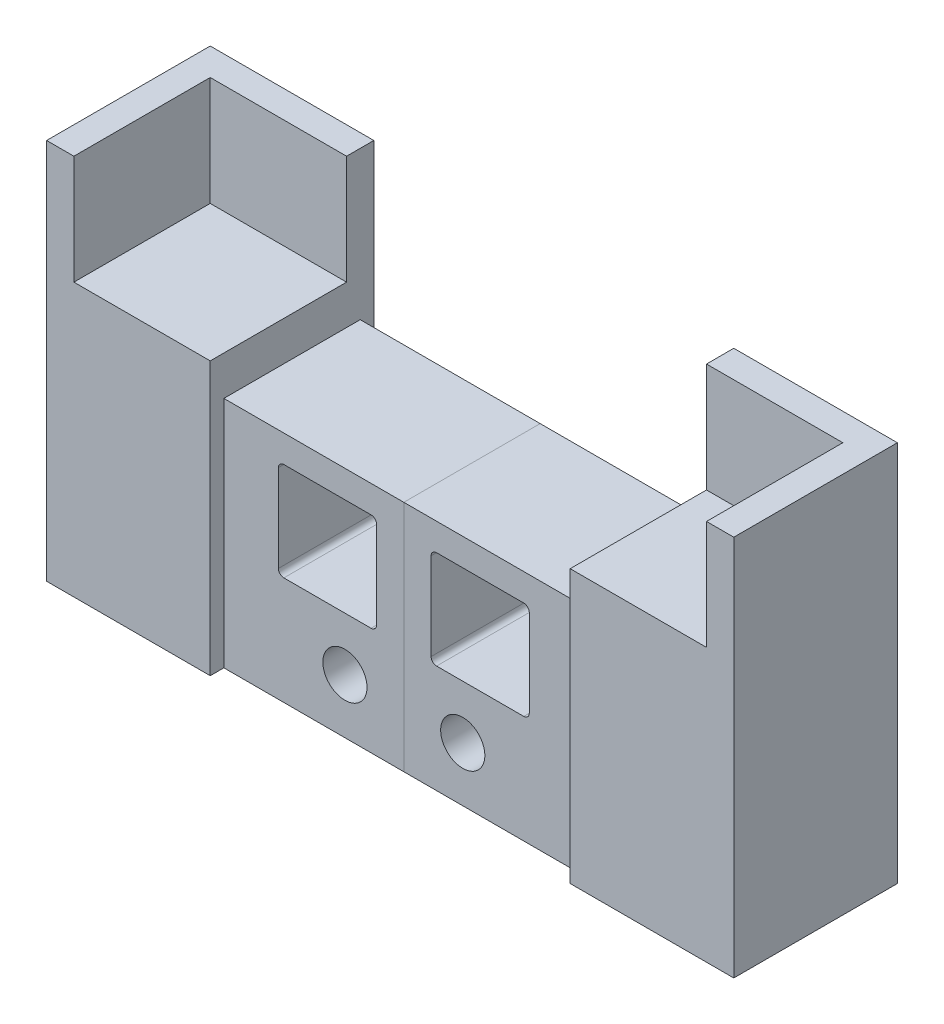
ISO-10303-21;
HEADER;
FILE_DESCRIPTION(('STEP AP214'),'2;1');
FILE_NAME('part.step','',(''),(''),'','','');
FILE_SCHEMA(('AUTOMOTIVE_DESIGN { 1 0 10303 214 1 1 1 1 }'));
ENDSEC;
DATA;
#1=APPLICATION_CONTEXT('core data for automotive mechanical design processes');
#2=APPLICATION_PROTOCOL_DEFINITION('international standard','automotive_design',2000,#1);
#3=PRODUCT_CONTEXT('',#1,'mechanical');
#4=PRODUCT('Part','Part','',(#3));
#5=PRODUCT_RELATED_PRODUCT_CATEGORY('part','',(#4));
#6=PRODUCT_DEFINITION_FORMATION('','',#4);
#7=PRODUCT_DEFINITION_CONTEXT('part definition',#1,'design');
#8=PRODUCT_DEFINITION('design','',#6,#7);
#9=PRODUCT_DEFINITION_SHAPE('','',#8);
#10=(LENGTH_UNIT() NAMED_UNIT(*) SI_UNIT(.MILLI.,.METRE.));
#11=(NAMED_UNIT(*) PLANE_ANGLE_UNIT() SI_UNIT($,.RADIAN.));
#12=(NAMED_UNIT(*) SI_UNIT($,.STERADIAN.) SOLID_ANGLE_UNIT());
#13=UNCERTAINTY_MEASURE_WITH_UNIT(LENGTH_MEASURE(1.E-05),#10,'distance_accuracy_value','');
#14=(GEOMETRIC_REPRESENTATION_CONTEXT(3) GLOBAL_UNCERTAINTY_ASSIGNED_CONTEXT((#13)) GLOBAL_UNIT_ASSIGNED_CONTEXT((#10,
#11,#12)) REPRESENTATION_CONTEXT('',''));
#15=CARTESIAN_POINT('',(0.,0.,0.));
#16=DIRECTION('',(0.,0.,1.));
#17=DIRECTION('',(1.,0.,0.));
#18=AXIS2_PLACEMENT_3D('',#15,#16,#17);
#19=CARTESIAN_POINT('',(96.,50.,0.));
#20=DIRECTION('',(0.,-1.,0.));
#21=DIRECTION('',(0.,0.,-1.));
#22=AXIS2_PLACEMENT_3D('',#19,#20,#21);
#23=PLANE('',#22);
#24=DIRECTION('',(-1.,0.,0.));
#25=VECTOR('',#24,1.);
#26=CARTESIAN_POINT('',(81.,50.,-9.99999999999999));
#27=LINE('',#26,#25);
#28=CARTESIAN_POINT('',(106.,50.,-9.99999999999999));
#29=VERTEX_POINT('',#28);
#30=CARTESIAN_POINT('',(81.,50.,-9.99999999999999));
#31=VERTEX_POINT('',#30);
#32=EDGE_CURVE('E238',#29,#31,#27,.T.);
#33=ORIENTED_EDGE('',*,*,#32,.T.);
#34=DIRECTION('',(0.,0.,-1.));
#35=VECTOR('',#34,1.);
#36=CARTESIAN_POINT('',(81.,50.,15.));
#37=LINE('',#36,#35);
#38=CARTESIAN_POINT('',(81.,50.,15.));
#39=VERTEX_POINT('',#38);
#40=EDGE_CURVE('E359',#39,#31,#37,.T.);
#41=ORIENTED_EDGE('',*,*,#40,.F.);
#42=DIRECTION('',(-1.,0.,0.));
#43=VECTOR('',#42,1.);
#44=CARTESIAN_POINT('',(111.,50.,15.));
#45=LINE('',#44,#43);
#46=CARTESIAN_POINT('',(106.,50.,15.));
#47=VERTEX_POINT('',#46);
#48=EDGE_CURVE('E361',#47,#39,#45,.T.);
#49=ORIENTED_EDGE('',*,*,#48,.F.);
#50=DIRECTION('',(0.,0.,-1.));
#51=VECTOR('',#50,1.);
#52=CARTESIAN_POINT('',(106.,50.,-9.99999999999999));
#53=LINE('',#52,#51);
#54=EDGE_CURVE('E241',#47,#29,#53,.T.);
#55=ORIENTED_EDGE('',*,*,#54,.T.);
#56=EDGE_LOOP('',(#33,#41,#49,#55));
#57=FACE_BOUND('',#56,.T.);
#58=ADVANCED_FACE('F54',(#57),#23,.F.);
#59=CARTESIAN_POINT('',(58.8,10.,-12.5));
#60=DIRECTION('',(0.,0.,1.));
#61=DIRECTION('',(-1.,0.,0.));
#62=AXIS2_PLACEMENT_3D('',#59,#60,#61);
#63=CYLINDRICAL_SURFACE('',#62,4.05);
#64=CARTESIAN_POINT('',(58.8,10.,12.5));
#65=DIRECTION('',(0.,0.,-1.));
#66=DIRECTION('',(-1.,0.,0.));
#67=AXIS2_PLACEMENT_3D('',#64,#65,#66);
#68=CIRCLE('',#67,4.05);
#69=CARTESIAN_POINT('',(54.75,10.,12.5));
#70=VERTEX_POINT('',#69);
#71=EDGE_CURVE('E280',#70,#70,#68,.T.);
#72=ORIENTED_EDGE('',*,*,#71,.F.);
#73=EDGE_LOOP('',(#72));
#74=FACE_BOUND('',#73,.T.);
#75=CARTESIAN_POINT('',(58.8,10.,5.));
#76=DIRECTION('',(0.,0.,1.));
#77=DIRECTION('',(1.,0.,0.));
#78=AXIS2_PLACEMENT_3D('',#75,#76,#77);
#79=CIRCLE('',#78,4.05);
#80=CARTESIAN_POINT('',(62.85,10.,5.));
#81=VERTEX_POINT('',#80);
#82=EDGE_CURVE('E14',#81,#81,#79,.F.);
#83=ORIENTED_EDGE('',*,*,#82,.T.);
#84=EDGE_LOOP('',(#83));
#85=FACE_BOUND('',#84,.T.);
#86=ADVANCED_FACE('F425',(#74,#85),#63,.F.);
#87=CARTESIAN_POINT('',(81.,50.,15.));
#88=DIRECTION('',(1.,0.,0.));
#89=DIRECTION('',(0.,0.,1.));
#90=AXIS2_PLACEMENT_3D('',#87,#88,#89);
#91=PLANE('',#90);
#92=DIRECTION('',(0.,-1.,0.));
#93=VECTOR('',#92,1.);
#94=CARTESIAN_POINT('',(81.,42.79,12.5));
#95=LINE('',#94,#93);
#96=CARTESIAN_POINT('',(81.,42.79,12.5));
#97=VERTEX_POINT('',#96);
#98=CARTESIAN_POINT('',(81.,0.,12.5));
#99=VERTEX_POINT('',#98);
#100=EDGE_CURVE('E285',#97,#99,#95,.T.);
#101=ORIENTED_EDGE('',*,*,#100,.T.);
#102=DIRECTION('',(0.,0.,-1.));
#103=VECTOR('',#102,1.);
#104=CARTESIAN_POINT('',(81.,0.,15.));
#105=LINE('',#104,#103);
#106=CARTESIAN_POINT('',(81.,0.,15.));
#107=VERTEX_POINT('',#106);
#108=EDGE_CURVE('E365',#107,#99,#105,.T.);
#109=ORIENTED_EDGE('',*,*,#108,.F.);
#110=DIRECTION('',(0.,-1.,0.));
#111=VECTOR('',#110,1.);
#112=CARTESIAN_POINT('',(81.,50.,15.));
#113=LINE('',#112,#111);
#114=EDGE_CURVE('E364',#39,#107,#113,.T.);
#115=ORIENTED_EDGE('',*,*,#114,.F.);
#116=ORIENTED_EDGE('',*,*,#40,.T.);
#117=DIRECTION('',(0.,-1.,0.));
#118=VECTOR('',#117,1.);
#119=CARTESIAN_POINT('',(81.,70.,-9.99999999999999));
#120=LINE('',#119,#118);
#121=CARTESIAN_POINT('',(81.,70.,-9.99999999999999));
#122=VERTEX_POINT('',#121);
#123=EDGE_CURVE('E79',#122,#31,#120,.T.);
#124=ORIENTED_EDGE('',*,*,#123,.F.);
#125=DIRECTION('',(0.,0.,-1.));
#126=VECTOR('',#125,1.);
#127=CARTESIAN_POINT('',(81.,70.,-15.));
#128=LINE('',#127,#126);
#129=CARTESIAN_POINT('',(81.,70.,-15.));
#130=VERTEX_POINT('',#129);
#131=EDGE_CURVE('E250',#122,#130,#128,.T.);
#132=ORIENTED_EDGE('',*,*,#131,.T.);
#133=DIRECTION('',(0.,-1.,0.));
#134=VECTOR('',#133,1.);
#135=CARTESIAN_POINT('',(81.,50.,-15.));
#136=LINE('',#135,#134);
#137=CARTESIAN_POINT('',(81.,0.,-15.));
#138=VERTEX_POINT('',#137);
#139=EDGE_CURVE('E232',#130,#138,#136,.T.);
#140=ORIENTED_EDGE('',*,*,#139,.T.);
#141=CARTESIAN_POINT('',(81.,0.,-12.5));
#142=VERTEX_POINT('',#141);
#143=EDGE_CURVE('E358',#142,#138,#105,.T.);
#144=ORIENTED_EDGE('',*,*,#143,.F.);
#145=DIRECTION('',(0.,-1.,0.));
#146=VECTOR('',#145,1.);
#147=CARTESIAN_POINT('',(81.,42.79,-12.5));
#148=LINE('',#147,#146);
#149=CARTESIAN_POINT('',(81.,42.79,-12.5));
#150=VERTEX_POINT('',#149);
#151=EDGE_CURVE('E310',#150,#142,#148,.T.);
#152=ORIENTED_EDGE('',*,*,#151,.F.);
#153=DIRECTION('',(0.,0.,1.));
#154=VECTOR('',#153,1.);
#155=CARTESIAN_POINT('',(81.,42.79,-12.5));
#156=LINE('',#155,#154);
#157=EDGE_CURVE('E318',#150,#97,#156,.T.);
#158=ORIENTED_EDGE('',*,*,#157,.T.);
#159=EDGE_LOOP('',(#101,#109,#115,#116,#124,#132,#140,#144,#152,#158));
#160=FACE_BOUND('',#159,.T.);
#161=ADVANCED_FACE('F443',(#160),#91,.F.);
#162=CARTESIAN_POINT('',(111.,50.,-15.));
#163=DIRECTION('',(0.,0.,1.));
#164=DIRECTION('',(-1.,0.,0.));
#165=AXIS2_PLACEMENT_3D('',#162,#163,#164);
#166=PLANE('',#165);
#167=DIRECTION('',(1.,0.,0.));
#168=VECTOR('',#167,1.);
#169=CARTESIAN_POINT('',(111.,0.,-15.));
#170=LINE('',#169,#168);
#171=CARTESIAN_POINT('',(111.,0.,-15.));
#172=VERTEX_POINT('',#171);
#173=EDGE_CURVE('E368',#138,#172,#170,.T.);
#174=ORIENTED_EDGE('',*,*,#173,.F.);
#175=ORIENTED_EDGE('',*,*,#139,.F.);
#176=DIRECTION('',(1.,0.,0.));
#177=VECTOR('',#176,1.);
#178=CARTESIAN_POINT('',(81.,70.,-15.));
#179=LINE('',#178,#177);
#180=CARTESIAN_POINT('',(111.,70.,-15.));
#181=VERTEX_POINT('',#180);
#182=EDGE_CURVE('E218',#130,#181,#179,.T.);
#183=ORIENTED_EDGE('',*,*,#182,.T.);
#184=DIRECTION('',(0.,-1.,0.));
#185=VECTOR('',#184,1.);
#186=CARTESIAN_POINT('',(111.,50.,-15.));
#187=LINE('',#186,#185);
#188=EDGE_CURVE('E226',#181,#172,#187,.T.);
#189=ORIENTED_EDGE('',*,*,#188,.T.);
#190=EDGE_LOOP('',(#174,#175,#183,#189));
#191=FACE_BOUND('',#190,.T.);
#192=ADVANCED_FACE('F235',(#191),#166,.F.);
#193=CARTESIAN_POINT('',(111.,50.,15.));
#194=DIRECTION('',(-1.,0.,0.));
#195=DIRECTION('',(0.,0.,-1.));
#196=AXIS2_PLACEMENT_3D('',#193,#194,#195);
#197=PLANE('',#196);
#198=DIRECTION('',(0.,0.,1.));
#199=VECTOR('',#198,1.);
#200=CARTESIAN_POINT('',(111.,0.,15.));
#201=LINE('',#200,#199);
#202=CARTESIAN_POINT('',(111.,0.,15.));
#203=VERTEX_POINT('',#202);
#204=EDGE_CURVE('E229',#172,#203,#201,.T.);
#205=ORIENTED_EDGE('',*,*,#204,.F.);
#206=ORIENTED_EDGE('',*,*,#188,.F.);
#207=DIRECTION('',(0.,0.,1.));
#208=VECTOR('',#207,1.);
#209=CARTESIAN_POINT('',(111.,70.,-15.));
#210=LINE('',#209,#208);
#211=CARTESIAN_POINT('',(111.,70.,15.));
#212=VERTEX_POINT('',#211);
#213=EDGE_CURVE('E213',#181,#212,#210,.T.);
#214=ORIENTED_EDGE('',*,*,#213,.T.);
#215=DIRECTION('',(0.,-1.,0.));
#216=VECTOR('',#215,1.);
#217=CARTESIAN_POINT('',(111.,50.,15.));
#218=LINE('',#217,#216);
#219=EDGE_CURVE('E233',#212,#203,#218,.T.);
#220=ORIENTED_EDGE('',*,*,#219,.T.);
#221=EDGE_LOOP('',(#205,#206,#214,#220));
#222=FACE_BOUND('',#221,.T.);
#223=ADVANCED_FACE('F227',(#222),#197,.F.);
#224=CARTESIAN_POINT('',(111.,50.,15.));
#225=DIRECTION('',(0.,0.,-1.));
#226=DIRECTION('',(1.,0.,0.));
#227=AXIS2_PLACEMENT_3D('',#224,#225,#226);
#228=PLANE('',#227);
#229=DIRECTION('',(-1.,0.,0.));
#230=VECTOR('',#229,1.);
#231=CARTESIAN_POINT('',(111.,0.,15.));
#232=LINE('',#231,#230);
#233=EDGE_CURVE('E362',#203,#107,#232,.T.);
#234=ORIENTED_EDGE('',*,*,#233,.F.);
#235=ORIENTED_EDGE('',*,*,#219,.F.);
#236=DIRECTION('',(-1.,0.,0.));
#237=VECTOR('',#236,1.);
#238=CARTESIAN_POINT('',(106.,70.,15.));
#239=LINE('',#238,#237);
#240=CARTESIAN_POINT('',(106.,70.,15.));
#241=VERTEX_POINT('',#240);
#242=EDGE_CURVE('E220',#212,#241,#239,.T.);
#243=ORIENTED_EDGE('',*,*,#242,.T.);
#244=DIRECTION('',(0.,-1.,0.));
#245=VECTOR('',#244,1.);
#246=CARTESIAN_POINT('',(106.,70.,15.));
#247=LINE('',#246,#245);
#248=EDGE_CURVE('E71',#241,#47,#247,.T.);
#249=ORIENTED_EDGE('',*,*,#248,.T.);
#250=ORIENTED_EDGE('',*,*,#48,.T.);
#251=ORIENTED_EDGE('',*,*,#114,.T.);
#252=EDGE_LOOP('',(#234,#235,#243,#249,#250,#251));
#253=FACE_BOUND('',#252,.T.);
#254=ADVANCED_FACE('F454',(#253),#228,.F.);
#255=CARTESIAN_POINT('',(96.,0.,0.));
#256=DIRECTION('',(0.,-1.,0.));
#257=DIRECTION('',(0.,0.,-1.));
#258=AXIS2_PLACEMENT_3D('',#255,#256,#257);
#259=PLANE('',#258);
#260=DIRECTION('',(0.,0.,1.));
#261=VECTOR('',#260,1.);
#262=CARTESIAN_POINT('',(48.,0.,-12.5));
#263=LINE('',#262,#261);
#264=CARTESIAN_POINT('',(48.,0.,-12.5));
#265=VERTEX_POINT('',#264);
#266=CARTESIAN_POINT('',(48.,0.,12.5));
#267=VERTEX_POINT('',#266);
#268=EDGE_CURVE('E323',#265,#267,#263,.T.);
#269=ORIENTED_EDGE('',*,*,#268,.F.);
#270=DIRECTION('',(-1.,0.,0.));
#271=VECTOR('',#270,1.);
#272=CARTESIAN_POINT('',(48.,0.,-12.5));
#273=LINE('',#272,#271);
#274=EDGE_CURVE('E313',#142,#265,#273,.T.);
#275=ORIENTED_EDGE('',*,*,#274,.F.);
#276=ORIENTED_EDGE('',*,*,#143,.T.);
#277=ORIENTED_EDGE('',*,*,#173,.T.);
#278=ORIENTED_EDGE('',*,*,#204,.T.);
#279=ORIENTED_EDGE('',*,*,#233,.T.);
#280=ORIENTED_EDGE('',*,*,#108,.T.);
#281=DIRECTION('',(-1.,0.,0.));
#282=VECTOR('',#281,1.);
#283=CARTESIAN_POINT('',(48.,0.,12.5));
#284=LINE('',#283,#282);
#285=EDGE_CURVE('E288',#99,#267,#284,.T.);
#286=ORIENTED_EDGE('',*,*,#285,.T.);
#287=EDGE_LOOP('',(#269,#275,#276,#277,#278,#279,#280,#286));
#288=FACE_BOUND('',#287,.T.);
#289=DIRECTION('',(0.,0.,1.));
#290=VECTOR('',#289,1.);
#291=CARTESIAN_POINT('',(86.,0.,-10.));
#292=LINE('',#291,#290);
#293=CARTESIAN_POINT('',(86.,0.,-10.));
#294=VERTEX_POINT('',#293);
#295=CARTESIAN_POINT('',(86.,0.,10.));
#296=VERTEX_POINT('',#295);
#297=EDGE_CURVE('E322',#294,#296,#292,.T.);
#298=ORIENTED_EDGE('',*,*,#297,.T.);
#299=DIRECTION('',(1.,0.,0.));
#300=VECTOR('',#299,1.);
#301=CARTESIAN_POINT('',(106.,0.,10.));
#302=LINE('',#301,#300);
#303=CARTESIAN_POINT('',(106.,0.,10.));
#304=VERTEX_POINT('',#303);
#305=EDGE_CURVE('E341',#296,#304,#302,.T.);
#306=ORIENTED_EDGE('',*,*,#305,.T.);
#307=DIRECTION('',(0.,0.,-1.));
#308=VECTOR('',#307,1.);
#309=CARTESIAN_POINT('',(106.,0.,-10.));
#310=LINE('',#309,#308);
#311=CARTESIAN_POINT('',(106.,0.,-10.));
#312=VERTEX_POINT('',#311);
#313=EDGE_CURVE('E344',#304,#312,#310,.T.);
#314=ORIENTED_EDGE('',*,*,#313,.T.);
#315=DIRECTION('',(-1.,0.,0.));
#316=VECTOR('',#315,1.);
#317=CARTESIAN_POINT('',(106.,0.,-10.));
#318=LINE('',#317,#316);
#319=EDGE_CURVE('E347',#312,#294,#318,.T.);
#320=ORIENTED_EDGE('',*,*,#319,.T.);
#321=EDGE_LOOP('',(#298,#306,#314,#320));
#322=FACE_BOUND('',#321,.T.);
#323=ADVANCED_FACE('F447',(#288,#322),#259,.T.);
#324=CARTESIAN_POINT('',(86.,78.2842712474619,-10.));
#325=DIRECTION('',(-1.,0.,0.));
#326=DIRECTION('',(0.,0.,-1.));
#327=AXIS2_PLACEMENT_3D('',#324,#325,#326);
#328=PLANE('',#327);
#329=DIRECTION('',(0.,0.,-1.));
#330=VECTOR('',#329,1.);
#331=CARTESIAN_POINT('',(86.,45.,-10.));
#332=LINE('',#331,#330);
#333=CARTESIAN_POINT('',(86.,45.,10.));
#334=VERTEX_POINT('',#333);
#335=CARTESIAN_POINT('',(86.,45.,-10.));
#336=VERTEX_POINT('',#335);
#337=EDGE_CURVE('E335',#334,#336,#332,.T.);
#338=ORIENTED_EDGE('',*,*,#337,.F.);
#339=DIRECTION('',(0.,-1.,0.));
#340=VECTOR('',#339,1.);
#341=CARTESIAN_POINT('',(86.,78.2842712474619,10.));
#342=LINE('',#341,#340);
#343=EDGE_CURVE('E350',#334,#296,#342,.T.);
#344=ORIENTED_EDGE('',*,*,#343,.T.);
#345=ORIENTED_EDGE('',*,*,#297,.F.);
#346=DIRECTION('',(0.,-1.,0.));
#347=VECTOR('',#346,1.);
#348=CARTESIAN_POINT('',(86.,78.2842712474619,-10.));
#349=LINE('',#348,#347);
#350=EDGE_CURVE('E332',#336,#294,#349,.T.);
#351=ORIENTED_EDGE('',*,*,#350,.F.);
#352=EDGE_LOOP('',(#338,#344,#345,#351));
#353=FACE_BOUND('',#352,.T.);
#354=ADVANCED_FACE('F481',(#353),#328,.F.);
#355=CARTESIAN_POINT('',(106.,78.2842712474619,-10.));
#356=DIRECTION('',(0.,0.,-1.));
#357=DIRECTION('',(1.,0.,0.));
#358=AXIS2_PLACEMENT_3D('',#355,#356,#357);
#359=PLANE('',#358);
#360=DIRECTION('',(1.,0.,0.));
#361=VECTOR('',#360,1.);
#362=CARTESIAN_POINT('',(106.,45.,-10.));
#363=LINE('',#362,#361);
#364=CARTESIAN_POINT('',(106.,45.,-10.));
#365=VERTEX_POINT('',#364);
#366=EDGE_CURVE('E331',#336,#365,#363,.T.);
#367=ORIENTED_EDGE('',*,*,#366,.F.);
#368=ORIENTED_EDGE('',*,*,#350,.T.);
#369=ORIENTED_EDGE('',*,*,#319,.F.);
#370=DIRECTION('',(0.,-1.,0.));
#371=VECTOR('',#370,1.);
#372=CARTESIAN_POINT('',(106.,78.2842712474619,-10.));
#373=LINE('',#372,#371);
#374=EDGE_CURVE('E352',#365,#312,#373,.T.);
#375=ORIENTED_EDGE('',*,*,#374,.F.);
#376=EDGE_LOOP('',(#367,#368,#369,#375));
#377=FACE_BOUND('',#376,.T.);
#378=ADVANCED_FACE('F555',(#377),#359,.F.);
#379=CARTESIAN_POINT('',(106.,78.2842712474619,-10.));
#380=DIRECTION('',(1.,0.,0.));
#381=DIRECTION('',(0.,0.,1.));
#382=AXIS2_PLACEMENT_3D('',#379,#380,#381);
#383=PLANE('',#382);
#384=DIRECTION('',(0.,0.,1.));
#385=VECTOR('',#384,1.);
#386=CARTESIAN_POINT('',(106.,45.,-10.));
#387=LINE('',#386,#385);
#388=CARTESIAN_POINT('',(106.,45.,10.));
#389=VERTEX_POINT('',#388);
#390=EDGE_CURVE('E328',#365,#389,#387,.T.);
#391=ORIENTED_EDGE('',*,*,#390,.F.);
#392=ORIENTED_EDGE('',*,*,#374,.T.);
#393=ORIENTED_EDGE('',*,*,#313,.F.);
#394=DIRECTION('',(0.,-1.,0.));
#395=VECTOR('',#394,1.);
#396=CARTESIAN_POINT('',(106.,78.2842712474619,10.));
#397=LINE('',#396,#395);
#398=EDGE_CURVE('E354',#389,#304,#397,.T.);
#399=ORIENTED_EDGE('',*,*,#398,.F.);
#400=EDGE_LOOP('',(#391,#392,#393,#399));
#401=FACE_BOUND('',#400,.T.);
#402=ADVANCED_FACE('F558',(#401),#383,.F.);
#403=CARTESIAN_POINT('',(106.,78.2842712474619,10.));
#404=DIRECTION('',(0.,0.,1.));
#405=DIRECTION('',(-1.,0.,0.));
#406=AXIS2_PLACEMENT_3D('',#403,#404,#405);
#407=PLANE('',#406);
#408=DIRECTION('',(-1.,0.,0.));
#409=VECTOR('',#408,1.);
#410=CARTESIAN_POINT('',(106.,45.,10.));
#411=LINE('',#410,#409);
#412=EDGE_CURVE('E338',#389,#334,#411,.T.);
#413=ORIENTED_EDGE('',*,*,#412,.F.);
#414=ORIENTED_EDGE('',*,*,#398,.T.);
#415=ORIENTED_EDGE('',*,*,#305,.F.);
#416=ORIENTED_EDGE('',*,*,#343,.F.);
#417=EDGE_LOOP('',(#413,#414,#415,#416));
#418=FACE_BOUND('',#417,.T.);
#419=ADVANCED_FACE('F553',(#418),#407,.F.);
#420=CARTESIAN_POINT('',(96.,45.,0.));
#421=DIRECTION('',(0.,-1.,0.));
#422=DIRECTION('',(0.,0.,-1.));
#423=AXIS2_PLACEMENT_3D('',#420,#421,#422);
#424=PLANE('',#423);
#425=ORIENTED_EDGE('',*,*,#337,.T.);
#426=ORIENTED_EDGE('',*,*,#366,.T.);
#427=ORIENTED_EDGE('',*,*,#390,.T.);
#428=ORIENTED_EDGE('',*,*,#412,.T.);
#429=EDGE_LOOP('',(#425,#426,#427,#428));
#430=FACE_BOUND('',#429,.T.);
#431=ADVANCED_FACE('F550',(#430),#424,.T.);
#432=CARTESIAN_POINT('',(81.,42.79,-12.5));
#433=DIRECTION('',(0.,1.,0.));
#434=DIRECTION('',(0.,0.,1.));
#435=AXIS2_PLACEMENT_3D('',#432,#433,#434);
#436=PLANE('',#435);
#437=ORIENTED_EDGE('',*,*,#157,.F.);
#438=DIRECTION('',(1.,0.,0.));
#439=VECTOR('',#438,1.);
#440=CARTESIAN_POINT('',(81.,42.79,-12.5));
#441=LINE('',#440,#439);
#442=CARTESIAN_POINT('',(48.,42.79,-12.5));
#443=VERTEX_POINT('',#442);
#444=EDGE_CURVE('E308',#443,#150,#441,.T.);
#445=ORIENTED_EDGE('',*,*,#444,.F.);
#446=DIRECTION('',(0.,0.,1.));
#447=VECTOR('',#446,1.);
#448=CARTESIAN_POINT('',(48.,42.79,-12.5));
#449=LINE('',#448,#447);
#450=CARTESIAN_POINT('',(48.,42.79,12.5));
#451=VERTEX_POINT('',#450);
#452=EDGE_CURVE('E319',#443,#451,#449,.T.);
#453=ORIENTED_EDGE('',*,*,#452,.T.);
#454=DIRECTION('',(1.,0.,0.));
#455=VECTOR('',#454,1.);
#456=CARTESIAN_POINT('',(81.,42.79,12.5));
#457=LINE('',#456,#455);
#458=EDGE_CURVE('E283',#451,#97,#457,.T.);
#459=ORIENTED_EDGE('',*,*,#458,.T.);
#460=EDGE_LOOP('',(#437,#445,#453,#459));
#461=FACE_BOUND('',#460,.T.);
#462=ADVANCED_FACE('F439',(#461),#436,.T.);
#463=CARTESIAN_POINT('',(48.,42.79,-12.5));
#464=DIRECTION('',(-1.,0.,0.));
#465=DIRECTION('',(0.,1.,0.));
#466=AXIS2_PLACEMENT_3D('',#463,#464,#465);
#467=PLANE('',#466);
#468=CARTESIAN_POINT('',(48.,28.8,0.));
#469=DIRECTION('',(1.,0.,0.));
#470=DIRECTION('',(0.,1.,0.));
#471=AXIS2_PLACEMENT_3D('',#468,#469,#470);
#472=CIRCLE('',#471,2.);
#473=CARTESIAN_POINT('',(48.,30.8,0.));
#474=VERTEX_POINT('',#473);
#475=EDGE_CURVE('E258',#474,#474,#472,.T.);
#476=ORIENTED_EDGE('',*,*,#475,.T.);
#477=EDGE_LOOP('',(#476));
#478=FACE_BOUND('',#477,.T.);
#479=DIRECTION('',(0.,1.,0.));
#480=VECTOR('',#479,1.);
#481=CARTESIAN_POINT('',(48.,42.79,12.5));
#482=LINE('',#481,#480);
#483=EDGE_CURVE('E291',#267,#451,#482,.T.);
#484=ORIENTED_EDGE('',*,*,#483,.T.);
#485=ORIENTED_EDGE('',*,*,#452,.F.);
#486=DIRECTION('',(0.,1.,0.));
#487=VECTOR('',#486,1.);
#488=CARTESIAN_POINT('',(48.,42.79,-12.5));
#489=LINE('',#488,#487);
#490=EDGE_CURVE('E316',#265,#443,#489,.T.);
#491=ORIENTED_EDGE('',*,*,#490,.F.);
#492=ORIENTED_EDGE('',*,*,#268,.T.);
#493=EDGE_LOOP('',(#484,#485,#491,#492));
#494=FACE_BOUND('',#493,.T.);
#495=ADVANCED_FACE('F430',(#478,#494),#467,.T.);
#496=CARTESIAN_POINT('',(96.,0.,-12.5));
#497=DIRECTION('',(0.,0.,-1.));
#498=DIRECTION('',(1.,0.,0.));
#499=AXIS2_PLACEMENT_3D('',#496,#497,#498);
#500=PLANE('',#499);
#501=DIRECTION('',(0.,1.,0.));
#502=VECTOR('',#501,1.);
#503=CARTESIAN_POINT('',(53.,37.79,-12.5));
#504=LINE('',#503,#502);
#505=CARTESIAN_POINT('',(53.,20.79,-12.5));
#506=VERTEX_POINT('',#505);
#507=CARTESIAN_POINT('',(53.,36.79,-12.5));
#508=VERTEX_POINT('',#507);
#509=EDGE_CURVE('E302',#506,#508,#504,.T.);
#510=ORIENTED_EDGE('',*,*,#509,.F.);
#511=CARTESIAN_POINT('',(54.,20.79,-12.5));
#512=DIRECTION('',(0.,0.,1.));
#513=DIRECTION('',(1.,0.,0.));
#514=AXIS2_PLACEMENT_3D('',#511,#512,#513);
#515=CIRCLE('',#514,1.);
#516=CARTESIAN_POINT('',(54.,19.79,-12.5));
#517=VERTEX_POINT('',#516);
#518=EDGE_CURVE('E398',#517,#506,#515,.F.);
#519=ORIENTED_EDGE('',*,*,#518,.F.);
#520=DIRECTION('',(-1.,0.,0.));
#521=VECTOR('',#520,1.);
#522=CARTESIAN_POINT('',(71.,19.79,-12.5));
#523=LINE('',#522,#521);
#524=CARTESIAN_POINT('',(70.,19.79,-12.5));
#525=VERTEX_POINT('',#524);
#526=EDGE_CURVE('E299',#525,#517,#523,.T.);
#527=ORIENTED_EDGE('',*,*,#526,.F.);
#528=CARTESIAN_POINT('',(70.,20.79,-12.5));
#529=DIRECTION('',(0.,0.,1.));
#530=DIRECTION('',(1.,0.,0.));
#531=AXIS2_PLACEMENT_3D('',#528,#529,#530);
#532=CIRCLE('',#531,1.);
#533=CARTESIAN_POINT('',(71.,20.79,-12.5));
#534=VERTEX_POINT('',#533);
#535=EDGE_CURVE('E403',#534,#525,#532,.F.);
#536=ORIENTED_EDGE('',*,*,#535,.F.);
#537=DIRECTION('',(0.,-1.,0.));
#538=VECTOR('',#537,1.);
#539=CARTESIAN_POINT('',(71.,37.79,-12.5));
#540=LINE('',#539,#538);
#541=CARTESIAN_POINT('',(71.,36.79,-12.5));
#542=VERTEX_POINT('',#541);
#543=EDGE_CURVE('E296',#542,#534,#540,.T.);
#544=ORIENTED_EDGE('',*,*,#543,.F.);
#545=CARTESIAN_POINT('',(70.,36.79,-12.5));
#546=DIRECTION('',(0.,0.,1.));
#547=DIRECTION('',(1.,0.,0.));
#548=AXIS2_PLACEMENT_3D('',#545,#546,#547);
#549=CIRCLE('',#548,1.);
#550=CARTESIAN_POINT('',(70.,37.79,-12.5));
#551=VERTEX_POINT('',#550);
#552=EDGE_CURVE('E408',#551,#542,#549,.F.);
#553=ORIENTED_EDGE('',*,*,#552,.F.);
#554=DIRECTION('',(1.,0.,0.));
#555=VECTOR('',#554,1.);
#556=CARTESIAN_POINT('',(71.,37.79,-12.5));
#557=LINE('',#556,#555);
#558=CARTESIAN_POINT('',(54.,37.79,-12.5));
#559=VERTEX_POINT('',#558);
#560=EDGE_CURVE('E293',#559,#551,#557,.T.);
#561=ORIENTED_EDGE('',*,*,#560,.F.);
#562=CARTESIAN_POINT('',(54.,36.79,-12.5));
#563=DIRECTION('',(0.,0.,1.));
#564=DIRECTION('',(1.,0.,0.));
#565=AXIS2_PLACEMENT_3D('',#562,#563,#564);
#566=CIRCLE('',#565,1.);
#567=EDGE_CURVE('E63',#508,#559,#566,.F.);
#568=ORIENTED_EDGE('',*,*,#567,.F.);
#569=EDGE_LOOP('',(#510,#519,#527,#536,#544,#553,#561,#568));
#570=FACE_BOUND('',#569,.T.);
#571=CARTESIAN_POINT('',(58.8,10.,-12.5));
#572=DIRECTION('',(0.,0.,-1.));
#573=DIRECTION('',(-1.,0.,0.));
#574=AXIS2_PLACEMENT_3D('',#571,#572,#573);
#575=CIRCLE('',#574,4.05);
#576=CARTESIAN_POINT('',(54.75,10.,-12.5));
#577=VERTEX_POINT('',#576);
#578=EDGE_CURVE('E305',#577,#577,#575,.T.);
#579=ORIENTED_EDGE('',*,*,#578,.F.);
#580=EDGE_LOOP('',(#579));
#581=FACE_BOUND('',#580,.T.);
#582=ORIENTED_EDGE('',*,*,#444,.T.);
#583=ORIENTED_EDGE('',*,*,#151,.T.);
#584=ORIENTED_EDGE('',*,*,#274,.T.);
#585=ORIENTED_EDGE('',*,*,#490,.T.);
#586=EDGE_LOOP('',(#582,#583,#584,#585));
#587=FACE_BOUND('',#586,.T.);
#588=ADVANCED_FACE('F423',(#570,#581,#587),#500,.T.);
#589=CARTESIAN_POINT('',(58.8,10.,-2.5));
#590=DIRECTION('',(0.,0.,1.));
#591=DIRECTION('',(1.,0.,0.));
#592=AXIS2_PLACEMENT_3D('',#589,#590,#591);
#593=CIRCLE('',#592,4.05);
#594=CARTESIAN_POINT('',(62.85,10.,-2.5));
#595=VERTEX_POINT('',#594);
#596=EDGE_CURVE('E267',#595,#595,#593,.F.);
#597=ORIENTED_EDGE('',*,*,#596,.F.);
#598=EDGE_LOOP('',(#597));
#599=FACE_BOUND('',#598,.T.);
#600=ORIENTED_EDGE('',*,*,#578,.T.);
#601=EDGE_LOOP('',(#600));
#602=FACE_BOUND('',#601,.T.);
#603=ADVANCED_FACE('F419',(#599,#602),#63,.F.);
#604=CARTESIAN_POINT('',(71.,37.79,-12.5));
#605=DIRECTION('',(0.,1.,0.));
#606=DIRECTION('',(1.,0.,0.));
#607=AXIS2_PLACEMENT_3D('',#604,#605,#606);
#608=PLANE('',#607);
#609=DIRECTION('',(1.,0.,0.));
#610=VECTOR('',#609,1.);
#611=CARTESIAN_POINT('',(71.,37.79,12.5));
#612=LINE('',#611,#610);
#613=CARTESIAN_POINT('',(54.,37.79,12.5));
#614=VERTEX_POINT('',#613);
#615=CARTESIAN_POINT('',(70.,37.79,12.5));
#616=VERTEX_POINT('',#615);
#617=EDGE_CURVE('E268',#614,#616,#612,.T.);
#618=ORIENTED_EDGE('',*,*,#617,.F.);
#619=DIRECTION('',(0.,0.,1.));
#620=VECTOR('',#619,1.);
#621=CARTESIAN_POINT('',(54.,37.79,12.5));
#622=LINE('',#621,#620);
#623=EDGE_CURVE('E391',#559,#614,#622,.T.);
#624=ORIENTED_EDGE('',*,*,#623,.F.);
#625=ORIENTED_EDGE('',*,*,#560,.T.);
#626=DIRECTION('',(0.,0.,1.));
#627=VECTOR('',#626,1.);
#628=CARTESIAN_POINT('',(70.,37.79,-12.5));
#629=LINE('',#628,#627);
#630=EDGE_CURVE('E394',#616,#551,#629,.F.);
#631=ORIENTED_EDGE('',*,*,#630,.F.);
#632=EDGE_LOOP('',(#618,#624,#625,#631));
#633=FACE_BOUND('',#632,.T.);
#634=ADVANCED_FACE('F422',(#633),#608,.F.);
#635=CARTESIAN_POINT('',(53.,37.79,-12.5));
#636=DIRECTION('',(-1.,0.,0.));
#637=DIRECTION('',(0.,0.,-1.));
#638=AXIS2_PLACEMENT_3D('',#635,#636,#637);
#639=PLANE('',#638);
#640=CARTESIAN_POINT('',(53.,28.8,0.));
#641=DIRECTION('',(1.,0.,0.));
#642=DIRECTION('',(0.,0.,-1.));
#643=AXIS2_PLACEMENT_3D('',#640,#641,#642);
#644=CIRCLE('',#643,2.);
#645=CARTESIAN_POINT('',(53.,28.8,-2.));
#646=VERTEX_POINT('',#645);
#647=EDGE_CURVE('E264',#646,#646,#644,.T.);
#648=ORIENTED_EDGE('',*,*,#647,.F.);
#649=EDGE_LOOP('',(#648));
#650=FACE_BOUND('',#649,.T.);
#651=ORIENTED_EDGE('',*,*,#509,.T.);
#652=DIRECTION('',(0.,0.,1.));
#653=VECTOR('',#652,1.);
#654=CARTESIAN_POINT('',(53.,36.79,-12.5));
#655=LINE('',#654,#653);
#656=CARTESIAN_POINT('',(53.,36.79,12.5));
#657=VERTEX_POINT('',#656);
#658=EDGE_CURVE('E376',#657,#508,#655,.F.);
#659=ORIENTED_EDGE('',*,*,#658,.F.);
#660=DIRECTION('',(0.,1.,0.));
#661=VECTOR('',#660,1.);
#662=CARTESIAN_POINT('',(53.,37.79,12.5));
#663=LINE('',#662,#661);
#664=CARTESIAN_POINT('',(53.,20.79,12.5));
#665=VERTEX_POINT('',#664);
#666=EDGE_CURVE('E277',#665,#657,#663,.T.);
#667=ORIENTED_EDGE('',*,*,#666,.F.);
#668=DIRECTION('',(0.,0.,1.));
#669=VECTOR('',#668,1.);
#670=CARTESIAN_POINT('',(53.,20.79,12.5));
#671=LINE('',#670,#669);
#672=EDGE_CURVE('E378',#506,#665,#671,.T.);
#673=ORIENTED_EDGE('',*,*,#672,.F.);
#674=EDGE_LOOP('',(#651,#659,#667,#673));
#675=FACE_BOUND('',#674,.T.);
#676=ADVANCED_FACE('F525',(#650,#675),#639,.F.);
#677=CARTESIAN_POINT('',(71.,19.79,-12.5));
#678=DIRECTION('',(0.,-1.,0.));
#679=DIRECTION('',(-1.,0.,0.));
#680=AXIS2_PLACEMENT_3D('',#677,#678,#679);
#681=PLANE('',#680);
#682=DIRECTION('',(-1.,0.,0.));
#683=VECTOR('',#682,1.);
#684=CARTESIAN_POINT('',(71.,19.79,12.5));
#685=LINE('',#684,#683);
#686=CARTESIAN_POINT('',(70.,19.79,12.5));
#687=VERTEX_POINT('',#686);
#688=CARTESIAN_POINT('',(54.,19.79,12.5));
#689=VERTEX_POINT('',#688);
#690=EDGE_CURVE('E274',#687,#689,#685,.T.);
#691=ORIENTED_EDGE('',*,*,#690,.F.);
#692=DIRECTION('',(0.,0.,1.));
#693=VECTOR('',#692,1.);
#694=CARTESIAN_POINT('',(70.,19.79,12.5));
#695=LINE('',#694,#693);
#696=EDGE_CURVE('E381',#525,#687,#695,.T.);
#697=ORIENTED_EDGE('',*,*,#696,.F.);
#698=ORIENTED_EDGE('',*,*,#526,.T.);
#699=DIRECTION('',(0.,0.,1.));
#700=VECTOR('',#699,1.);
#701=CARTESIAN_POINT('',(54.,19.79,-12.5));
#702=LINE('',#701,#700);
#703=EDGE_CURVE('E384',#689,#517,#702,.F.);
#704=ORIENTED_EDGE('',*,*,#703,.F.);
#705=EDGE_LOOP('',(#691,#697,#698,#704));
#706=FACE_BOUND('',#705,.T.);
#707=ADVANCED_FACE('F530',(#706),#681,.F.);
#708=CARTESIAN_POINT('',(71.,37.79,-12.5));
#709=DIRECTION('',(1.,0.,0.));
#710=DIRECTION('',(0.,-1.,0.));
#711=AXIS2_PLACEMENT_3D('',#708,#709,#710);
#712=PLANE('',#711);
#713=CARTESIAN_POINT('',(71.,28.8,0.));
#714=DIRECTION('',(-1.,0.,0.));
#715=DIRECTION('',(0.,-1.,0.));
#716=AXIS2_PLACEMENT_3D('',#713,#714,#715);
#717=CIRCLE('',#716,2.);
#718=CARTESIAN_POINT('',(71.,26.8,0.));
#719=VERTEX_POINT('',#718);
#720=EDGE_CURVE('E58',#719,#719,#717,.T.);
#721=ORIENTED_EDGE('',*,*,#720,.F.);
#722=EDGE_LOOP('',(#721));
#723=FACE_BOUND('',#722,.T.);
#724=DIRECTION('',(0.,-1.,0.));
#725=VECTOR('',#724,1.);
#726=CARTESIAN_POINT('',(71.,37.79,12.5));
#727=LINE('',#726,#725);
#728=CARTESIAN_POINT('',(71.,36.79,12.5));
#729=VERTEX_POINT('',#728);
#730=CARTESIAN_POINT('',(71.,20.79,12.5));
#731=VERTEX_POINT('',#730);
#732=EDGE_CURVE('E271',#729,#731,#727,.T.);
#733=ORIENTED_EDGE('',*,*,#732,.F.);
#734=DIRECTION('',(0.,0.,1.));
#735=VECTOR('',#734,1.);
#736=CARTESIAN_POINT('',(71.,36.79,12.5));
#737=LINE('',#736,#735);
#738=EDGE_CURVE('E386',#542,#729,#737,.T.);
#739=ORIENTED_EDGE('',*,*,#738,.F.);
#740=ORIENTED_EDGE('',*,*,#543,.T.);
#741=DIRECTION('',(0.,0.,1.));
#742=VECTOR('',#741,1.);
#743=CARTESIAN_POINT('',(71.,20.79,-12.5));
#744=LINE('',#743,#742);
#745=EDGE_CURVE('E389',#731,#534,#744,.F.);
#746=ORIENTED_EDGE('',*,*,#745,.F.);
#747=EDGE_LOOP('',(#733,#739,#740,#746));
#748=FACE_BOUND('',#747,.T.);
#749=ADVANCED_FACE('F518',(#723,#748),#712,.F.);
#750=CARTESIAN_POINT('',(96.,0.,12.5));
#751=DIRECTION('',(0.,0.,-1.));
#752=DIRECTION('',(1.,0.,0.));
#753=AXIS2_PLACEMENT_3D('',#750,#751,#752);
#754=PLANE('',#753);
#755=ORIENTED_EDGE('',*,*,#71,.T.);
#756=EDGE_LOOP('',(#755));
#757=FACE_BOUND('',#756,.T.);
#758=ORIENTED_EDGE('',*,*,#458,.F.);
#759=ORIENTED_EDGE('',*,*,#483,.F.);
#760=ORIENTED_EDGE('',*,*,#285,.F.);
#761=ORIENTED_EDGE('',*,*,#100,.F.);
#762=EDGE_LOOP('',(#758,#759,#760,#761));
#763=FACE_BOUND('',#762,.T.);
#764=ORIENTED_EDGE('',*,*,#617,.T.);
#765=CARTESIAN_POINT('',(70.,36.79,12.5));
#766=DIRECTION('',(0.,0.,1.));
#767=DIRECTION('',(1.,0.,0.));
#768=AXIS2_PLACEMENT_3D('',#765,#766,#767);
#769=CIRCLE('',#768,1.);
#770=EDGE_CURVE('E406',#729,#616,#769,.T.);
#771=ORIENTED_EDGE('',*,*,#770,.F.);
#772=ORIENTED_EDGE('',*,*,#732,.T.);
#773=CARTESIAN_POINT('',(70.,20.79,12.5));
#774=DIRECTION('',(0.,0.,1.));
#775=DIRECTION('',(1.,0.,0.));
#776=AXIS2_PLACEMENT_3D('',#773,#774,#775);
#777=CIRCLE('',#776,1.);
#778=EDGE_CURVE('E401',#687,#731,#777,.T.);
#779=ORIENTED_EDGE('',*,*,#778,.F.);
#780=ORIENTED_EDGE('',*,*,#690,.T.);
#781=CARTESIAN_POINT('',(54.,20.79,12.5));
#782=DIRECTION('',(0.,0.,1.));
#783=DIRECTION('',(1.,0.,0.));
#784=AXIS2_PLACEMENT_3D('',#781,#782,#783);
#785=CIRCLE('',#784,1.);
#786=EDGE_CURVE('E396',#665,#689,#785,.T.);
#787=ORIENTED_EDGE('',*,*,#786,.F.);
#788=ORIENTED_EDGE('',*,*,#666,.T.);
#789=CARTESIAN_POINT('',(54.,36.79,12.5));
#790=DIRECTION('',(0.,0.,1.));
#791=DIRECTION('',(1.,0.,0.));
#792=AXIS2_PLACEMENT_3D('',#789,#790,#791);
#793=CIRCLE('',#792,1.);
#794=EDGE_CURVE('E411',#614,#657,#793,.T.);
#795=ORIENTED_EDGE('',*,*,#794,.F.);
#796=EDGE_LOOP('',(#764,#771,#772,#779,#780,#787,#788,#795));
#797=FACE_BOUND('',#796,.T.);
#798=ADVANCED_FACE('F451',(#757,#763,#797),#754,.F.);
#799=CARTESIAN_POINT('',(54.,20.79,-12.5));
#800=DIRECTION('',(0.,0.,-1.));
#801=DIRECTION('',(1.,0.,0.));
#802=AXIS2_PLACEMENT_3D('',#799,#800,#801);
#803=CYLINDRICAL_SURFACE('',#802,1.);
#804=ORIENTED_EDGE('',*,*,#518,.T.);
#805=ORIENTED_EDGE('',*,*,#672,.T.);
#806=ORIENTED_EDGE('',*,*,#786,.T.);
#807=ORIENTED_EDGE('',*,*,#703,.T.);
#808=EDGE_LOOP('',(#804,#805,#806,#807));
#809=FACE_BOUND('',#808,.T.);
#810=ADVANCED_FACE('F493',(#809),#803,.F.);
#811=CARTESIAN_POINT('',(70.,20.79,-12.5));
#812=DIRECTION('',(0.,0.,-1.));
#813=DIRECTION('',(1.,0.,0.));
#814=AXIS2_PLACEMENT_3D('',#811,#812,#813);
#815=CYLINDRICAL_SURFACE('',#814,1.);
#816=ORIENTED_EDGE('',*,*,#535,.T.);
#817=ORIENTED_EDGE('',*,*,#696,.T.);
#818=ORIENTED_EDGE('',*,*,#778,.T.);
#819=ORIENTED_EDGE('',*,*,#745,.T.);
#820=EDGE_LOOP('',(#816,#817,#818,#819));
#821=FACE_BOUND('',#820,.T.);
#822=ADVANCED_FACE('F496',(#821),#815,.F.);
#823=CARTESIAN_POINT('',(70.,36.79,-12.5));
#824=DIRECTION('',(0.,0.,-1.));
#825=DIRECTION('',(1.,0.,0.));
#826=AXIS2_PLACEMENT_3D('',#823,#824,#825);
#827=CYLINDRICAL_SURFACE('',#826,1.);
#828=ORIENTED_EDGE('',*,*,#552,.T.);
#829=ORIENTED_EDGE('',*,*,#738,.T.);
#830=ORIENTED_EDGE('',*,*,#770,.T.);
#831=ORIENTED_EDGE('',*,*,#630,.T.);
#832=EDGE_LOOP('',(#828,#829,#830,#831));
#833=FACE_BOUND('',#832,.T.);
#834=ADVANCED_FACE('F499',(#833),#827,.F.);
#835=CARTESIAN_POINT('',(54.,36.79,-12.5));
#836=DIRECTION('',(0.,0.,-1.));
#837=DIRECTION('',(1.,0.,0.));
#838=AXIS2_PLACEMENT_3D('',#835,#836,#837);
#839=CYLINDRICAL_SURFACE('',#838,1.);
#840=ORIENTED_EDGE('',*,*,#567,.T.);
#841=ORIENTED_EDGE('',*,*,#623,.T.);
#842=ORIENTED_EDGE('',*,*,#794,.T.);
#843=ORIENTED_EDGE('',*,*,#658,.T.);
#844=EDGE_LOOP('',(#840,#841,#842,#843));
#845=FACE_BOUND('',#844,.T.);
#846=ADVANCED_FACE('F56',(#845),#839,.F.);
#847=CARTESIAN_POINT('',(111.,50.,5.));
#848=DIRECTION('',(0.,0.,-1.));
#849=DIRECTION('',(1.,0.,0.));
#850=AXIS2_PLACEMENT_3D('',#847,#848,#849);
#851=PLANE('',#850);
#852=ORIENTED_EDGE('',*,*,#82,.F.);
#853=EDGE_LOOP('',(#852));
#854=FACE_BOUND('',#853,.T.);
#855=ADVANCED_FACE('F506',(#854),#851,.F.);
#856=CARTESIAN_POINT('',(96.,0.,-2.5));
#857=DIRECTION('',(0.,0.,-1.));
#858=DIRECTION('',(1.,0.,0.));
#859=AXIS2_PLACEMENT_3D('',#856,#857,#858);
#860=PLANE('',#859);
#861=ORIENTED_EDGE('',*,*,#596,.T.);
#862=EDGE_LOOP('',(#861));
#863=FACE_BOUND('',#862,.T.);
#864=ADVANCED_FACE('F417',(#863),#860,.T.);
#865=CARTESIAN_POINT('',(76.,37.79,-12.5));
#866=DIRECTION('',(1.,0.,0.));
#867=DIRECTION('',(0.,-1.,0.));
#868=AXIS2_PLACEMENT_3D('',#865,#866,#867);
#869=PLANE('',#868);
#870=CARTESIAN_POINT('',(76.,28.8,0.));
#871=DIRECTION('',(-1.,0.,0.));
#872=DIRECTION('',(0.,-1.,0.));
#873=AXIS2_PLACEMENT_3D('',#870,#871,#872);
#874=CIRCLE('',#873,2.);
#875=CARTESIAN_POINT('',(76.,26.8,0.));
#876=VERTEX_POINT('',#875);
#877=EDGE_CURVE('E261',#876,#876,#874,.F.);
#878=ORIENTED_EDGE('',*,*,#877,.F.);
#879=EDGE_LOOP('',(#878));
#880=FACE_BOUND('',#879,.T.);
#881=ADVANCED_FACE('F716',(#880),#869,.F.);
#882=CARTESIAN_POINT('',(86.6568542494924,28.8,0.));
#883=DIRECTION('',(-1.,0.,0.));
#884=DIRECTION('',(0.,1.,0.));
#885=AXIS2_PLACEMENT_3D('',#882,#883,#884);
#886=CYLINDRICAL_SURFACE('',#885,2.);
#887=ORIENTED_EDGE('',*,*,#877,.T.);
#888=EDGE_LOOP('',(#887));
#889=FACE_BOUND('',#888,.T.);
#890=ORIENTED_EDGE('',*,*,#720,.T.);
#891=EDGE_LOOP('',(#890));
#892=FACE_BOUND('',#891,.T.);
#893=ADVANCED_FACE('F470',(#889,#892),#886,.F.);
#894=ORIENTED_EDGE('',*,*,#475,.F.);
#895=EDGE_LOOP('',(#894));
#896=FACE_BOUND('',#895,.T.);
#897=ORIENTED_EDGE('',*,*,#647,.T.);
#898=EDGE_LOOP('',(#897));
#899=FACE_BOUND('',#898,.T.);
#900=ADVANCED_FACE('F463',(#896,#899),#886,.F.);
#901=CARTESIAN_POINT('',(106.,70.,-9.99999999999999));
#902=DIRECTION('',(1.,0.,0.));
#903=DIRECTION('',(0.,0.,1.));
#904=AXIS2_PLACEMENT_3D('',#901,#902,#903);
#905=PLANE('',#904);
#906=ORIENTED_EDGE('',*,*,#54,.F.);
#907=ORIENTED_EDGE('',*,*,#248,.F.);
#908=DIRECTION('',(0.,0.,-1.));
#909=VECTOR('',#908,1.);
#910=CARTESIAN_POINT('',(106.,70.,-9.99999999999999));
#911=LINE('',#910,#909);
#912=CARTESIAN_POINT('',(106.,70.,-9.99999999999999));
#913=VERTEX_POINT('',#912);
#914=EDGE_CURVE('E245',#241,#913,#911,.T.);
#915=ORIENTED_EDGE('',*,*,#914,.T.);
#916=DIRECTION('',(0.,-1.,0.));
#917=VECTOR('',#916,1.);
#918=CARTESIAN_POINT('',(106.,70.,-9.99999999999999));
#919=LINE('',#918,#917);
#920=EDGE_CURVE('E255',#913,#29,#919,.T.);
#921=ORIENTED_EDGE('',*,*,#920,.T.);
#922=EDGE_LOOP('',(#906,#907,#915,#921));
#923=FACE_BOUND('',#922,.T.);
#924=ADVANCED_FACE('F461',(#923),#905,.F.);
#925=CARTESIAN_POINT('',(81.,70.,-9.99999999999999));
#926=DIRECTION('',(0.,0.,-1.));
#927=DIRECTION('',(1.,0.,0.));
#928=AXIS2_PLACEMENT_3D('',#925,#926,#927);
#929=PLANE('',#928);
#930=ORIENTED_EDGE('',*,*,#32,.F.);
#931=ORIENTED_EDGE('',*,*,#920,.F.);
#932=DIRECTION('',(-1.,0.,0.));
#933=VECTOR('',#932,1.);
#934=CARTESIAN_POINT('',(81.,70.,-9.99999999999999));
#935=LINE('',#934,#933);
#936=EDGE_CURVE('E248',#913,#122,#935,.T.);
#937=ORIENTED_EDGE('',*,*,#936,.T.);
#938=ORIENTED_EDGE('',*,*,#123,.T.);
#939=EDGE_LOOP('',(#930,#931,#937,#938));
#940=FACE_BOUND('',#939,.T.);
#941=ADVANCED_FACE('F459',(#940),#929,.F.);
#942=CARTESIAN_POINT('',(96.,70.,0.));
#943=DIRECTION('',(0.,1.,0.));
#944=DIRECTION('',(0.,0.,1.));
#945=AXIS2_PLACEMENT_3D('',#942,#943,#944);
#946=PLANE('',#945);
#947=ORIENTED_EDGE('',*,*,#182,.F.);
#948=ORIENTED_EDGE('',*,*,#131,.F.);
#949=ORIENTED_EDGE('',*,*,#936,.F.);
#950=ORIENTED_EDGE('',*,*,#914,.F.);
#951=ORIENTED_EDGE('',*,*,#242,.F.);
#952=ORIENTED_EDGE('',*,*,#213,.F.);
#953=EDGE_LOOP('',(#947,#948,#949,#950,#951,#952));
#954=FACE_BOUND('',#953,.T.);
#955=ADVANCED_FACE('F215',(#954),#946,.T.);
#956=CLOSED_SHELL('',(#58,#86,#161,#192,#223,#254,#323,#354,#378,#402,#419,#431,#462,#495,#588,
#603,#634,#676,#707,#749,#798,#810,#822,#834,#846,#855,#864,#881,#893,#900,#924,#941,#955));
#957=MANIFOLD_SOLID_BREP('B2',#956);
#958=CARTESIAN_POINT('',(0.,50.,0.));
#959=DIRECTION('',(0.,-1.,0.));
#960=DIRECTION('',(0.,0.,-1.));
#961=AXIS2_PLACEMENT_3D('',#958,#959,#960);
#962=PLANE('',#961);
#963=DIRECTION('',(1.,0.,0.));
#964=VECTOR('',#963,1.);
#965=CARTESIAN_POINT('',(15.,50.,-9.99999999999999));
#966=LINE('',#965,#964);
#967=CARTESIAN_POINT('',(-10.,50.,-9.99999999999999));
#968=VERTEX_POINT('',#967);
#969=CARTESIAN_POINT('',(15.,50.,-9.99999999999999));
#970=VERTEX_POINT('',#969);
#971=EDGE_CURVE('E1056',#968,#970,#966,.T.);
#972=ORIENTED_EDGE('',*,*,#971,.F.);
#973=DIRECTION('',(0.,0.,-1.));
#974=VECTOR('',#973,1.);
#975=CARTESIAN_POINT('',(-10.,50.,-9.99999999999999));
#976=LINE('',#975,#974);
#977=CARTESIAN_POINT('',(-10.,50.,15.));
#978=VERTEX_POINT('',#977);
#979=EDGE_CURVE('E892',#978,#968,#976,.T.);
#980=ORIENTED_EDGE('',*,*,#979,.F.);
#981=DIRECTION('',(1.,0.,0.));
#982=VECTOR('',#981,1.);
#983=CARTESIAN_POINT('',(-15.,50.,15.));
#984=LINE('',#983,#982);
#985=CARTESIAN_POINT('',(15.,50.,15.));
#986=VERTEX_POINT('',#985);
#987=EDGE_CURVE('E1175',#978,#986,#984,.T.);
#988=ORIENTED_EDGE('',*,*,#987,.T.);
#989=DIRECTION('',(0.,0.,-1.));
#990=VECTOR('',#989,1.);
#991=CARTESIAN_POINT('',(15.,50.,15.));
#992=LINE('',#991,#990);
#993=EDGE_CURVE('E897',#986,#970,#992,.T.);
#994=ORIENTED_EDGE('',*,*,#993,.T.);
#995=EDGE_LOOP('',(#972,#980,#988,#994));
#996=FACE_BOUND('',#995,.T.);
#997=ADVANCED_FACE('F875',(#996),#962,.F.);
#998=CARTESIAN_POINT('',(37.2,9.99999999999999,-12.5));
#999=DIRECTION('',(0.,0.,1.));
#1000=DIRECTION('',(1.,0.,0.));
#1001=AXIS2_PLACEMENT_3D('',#998,#999,#1000);
#1002=CYLINDRICAL_SURFACE('',#1001,4.05);
#1003=CARTESIAN_POINT('',(37.2,9.99999999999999,12.5));
#1004=DIRECTION('',(0.,0.,1.));
#1005=DIRECTION('',(1.,0.,0.));
#1006=AXIS2_PLACEMENT_3D('',#1003,#1004,#1005);
#1007=CIRCLE('',#1006,4.05);
#1008=CARTESIAN_POINT('',(41.25,9.99999999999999,12.5));
#1009=VERTEX_POINT('',#1008);
#1010=EDGE_CURVE('E1098',#1009,#1009,#1007,.T.);
#1011=ORIENTED_EDGE('',*,*,#1010,.T.);
#1012=EDGE_LOOP('',(#1011));
#1013=FACE_BOUND('',#1012,.T.);
#1014=CARTESIAN_POINT('',(37.2,9.99999999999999,5.));
#1015=DIRECTION('',(0.,0.,-1.));
#1016=DIRECTION('',(-1.,0.,0.));
#1017=AXIS2_PLACEMENT_3D('',#1014,#1015,#1016);
#1018=CIRCLE('',#1017,4.05);
#1019=CARTESIAN_POINT('',(33.15,9.99999999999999,5.));
#1020=VERTEX_POINT('',#1019);
#1021=EDGE_CURVE('E52',#1020,#1020,#1018,.F.);
#1022=ORIENTED_EDGE('',*,*,#1021,.F.);
#1023=EDGE_LOOP('',(#1022));
#1024=FACE_BOUND('',#1023,.T.);
#1025=ADVANCED_FACE('F1246',(#1013,#1024),#1002,.F.);
#1026=CARTESIAN_POINT('',(15.,50.,15.));
#1027=DIRECTION('',(-1.,0.,0.));
#1028=DIRECTION('',(0.,0.,1.));
#1029=AXIS2_PLACEMENT_3D('',#1026,#1027,#1028);
#1030=PLANE('',#1029);
#1031=DIRECTION('',(0.,-1.,0.));
#1032=VECTOR('',#1031,1.);
#1033=CARTESIAN_POINT('',(15.,42.79,12.5));
#1034=LINE('',#1033,#1032);
#1035=CARTESIAN_POINT('',(15.,42.79,12.5));
#1036=VERTEX_POINT('',#1035);
#1037=CARTESIAN_POINT('',(15.,0.,12.5));
#1038=VERTEX_POINT('',#1037);
#1039=EDGE_CURVE('E1104',#1036,#1038,#1034,.T.);
#1040=ORIENTED_EDGE('',*,*,#1039,.F.);
#1041=DIRECTION('',(0.,0.,1.));
#1042=VECTOR('',#1041,1.);
#1043=CARTESIAN_POINT('',(15.,42.79,-12.5));
#1044=LINE('',#1043,#1042);
#1045=CARTESIAN_POINT('',(15.,42.79,-12.5));
#1046=VERTEX_POINT('',#1045);
#1047=EDGE_CURVE('E1139',#1046,#1036,#1044,.T.);
#1048=ORIENTED_EDGE('',*,*,#1047,.F.);
#1049=DIRECTION('',(0.,-1.,0.));
#1050=VECTOR('',#1049,1.);
#1051=CARTESIAN_POINT('',(15.,42.79,-12.5));
#1052=LINE('',#1051,#1050);
#1053=CARTESIAN_POINT('',(15.,0.,-12.5));
#1054=VERTEX_POINT('',#1053);
#1055=EDGE_CURVE('E1130',#1046,#1054,#1052,.T.);
#1056=ORIENTED_EDGE('',*,*,#1055,.T.);
#1057=DIRECTION('',(0.,0.,-1.));
#1058=VECTOR('',#1057,1.);
#1059=CARTESIAN_POINT('',(15.,0.,15.));
#1060=LINE('',#1059,#1058);
#1061=CARTESIAN_POINT('',(15.,0.,-15.));
#1062=VERTEX_POINT('',#1061);
#1063=EDGE_CURVE('E1173',#1054,#1062,#1060,.T.);
#1064=ORIENTED_EDGE('',*,*,#1063,.T.);
#1065=DIRECTION('',(0.,-1.,0.));
#1066=VECTOR('',#1065,1.);
#1067=CARTESIAN_POINT('',(15.,50.,-15.));
#1068=LINE('',#1067,#1066);
#1069=CARTESIAN_POINT('',(15.,70.,-15.));
#1070=VERTEX_POINT('',#1069);
#1071=EDGE_CURVE('E1041',#1070,#1062,#1068,.T.);
#1072=ORIENTED_EDGE('',*,*,#1071,.F.);
#1073=DIRECTION('',(0.,0.,-1.));
#1074=VECTOR('',#1073,1.);
#1075=CARTESIAN_POINT('',(15.,70.,-15.));
#1076=LINE('',#1075,#1074);
#1077=CARTESIAN_POINT('',(15.,70.,-9.99999999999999));
#1078=VERTEX_POINT('',#1077);
#1079=EDGE_CURVE('E1055',#1078,#1070,#1076,.T.);
#1080=ORIENTED_EDGE('',*,*,#1079,.F.);
#1081=DIRECTION('',(0.,-1.,0.));
#1082=VECTOR('',#1081,1.);
#1083=CARTESIAN_POINT('',(15.,70.,-9.99999999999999));
#1084=LINE('',#1083,#1082);
#1085=EDGE_CURVE('E1066',#1078,#970,#1084,.T.);
#1086=ORIENTED_EDGE('',*,*,#1085,.T.);
#1087=ORIENTED_EDGE('',*,*,#993,.F.);
#1088=DIRECTION('',(0.,-1.,0.));
#1089=VECTOR('',#1088,1.);
#1090=CARTESIAN_POINT('',(15.,50.,15.));
#1091=LINE('',#1090,#1089);
#1092=CARTESIAN_POINT('',(15.,0.,15.));
#1093=VERTEX_POINT('',#1092);
#1094=EDGE_CURVE('E1178',#986,#1093,#1091,.T.);
#1095=ORIENTED_EDGE('',*,*,#1094,.T.);
#1096=EDGE_CURVE('E1179',#1093,#1038,#1060,.T.);
#1097=ORIENTED_EDGE('',*,*,#1096,.T.);
#1098=EDGE_LOOP('',(#1040,#1048,#1056,#1064,#1072,#1080,#1086,#1087,#1095,#1097));
#1099=FACE_BOUND('',#1098,.T.);
#1100=ADVANCED_FACE('F1251',(#1099),#1030,.F.);
#1101=CARTESIAN_POINT('',(-15.,50.,-15.));
#1102=DIRECTION('',(0.,0.,1.));
#1103=DIRECTION('',(1.,0.,0.));
#1104=AXIS2_PLACEMENT_3D('',#1101,#1102,#1103);
#1105=PLANE('',#1104);
#1106=DIRECTION('',(-1.,0.,0.));
#1107=VECTOR('',#1106,1.);
#1108=CARTESIAN_POINT('',(-15.,0.,-15.));
#1109=LINE('',#1108,#1107);
#1110=CARTESIAN_POINT('',(-15.,0.,-15.));
#1111=VERTEX_POINT('',#1110);
#1112=EDGE_CURVE('E1038',#1062,#1111,#1109,.T.);
#1113=ORIENTED_EDGE('',*,*,#1112,.T.);
#1114=DIRECTION('',(0.,-1.,0.));
#1115=VECTOR('',#1114,1.);
#1116=CARTESIAN_POINT('',(-15.,50.,-15.));
#1117=LINE('',#1116,#1115);
#1118=CARTESIAN_POINT('',(-15.,70.,-15.));
#1119=VERTEX_POINT('',#1118);
#1120=EDGE_CURVE('E1031',#1119,#1111,#1117,.T.);
#1121=ORIENTED_EDGE('',*,*,#1120,.F.);
#1122=DIRECTION('',(-1.,0.,0.));
#1123=VECTOR('',#1122,1.);
#1124=CARTESIAN_POINT('',(15.,70.,-15.));
#1125=LINE('',#1124,#1123);
#1126=EDGE_CURVE('E1036',#1070,#1119,#1125,.T.);
#1127=ORIENTED_EDGE('',*,*,#1126,.F.);
#1128=ORIENTED_EDGE('',*,*,#1071,.T.);
#1129=EDGE_LOOP('',(#1113,#1121,#1127,#1128));
#1130=FACE_BOUND('',#1129,.T.);
#1131=ADVANCED_FACE('F1033',(#1130),#1105,.F.);
#1132=CARTESIAN_POINT('',(-15.,50.,15.));
#1133=DIRECTION('',(1.,0.,0.));
#1134=DIRECTION('',(0.,0.,-1.));
#1135=AXIS2_PLACEMENT_3D('',#1132,#1133,#1134);
#1136=PLANE('',#1135);
#1137=DIRECTION('',(0.,0.,1.));
#1138=VECTOR('',#1137,1.);
#1139=CARTESIAN_POINT('',(-15.,0.,15.));
#1140=LINE('',#1139,#1138);
#1141=CARTESIAN_POINT('',(-15.,0.,15.));
#1142=VERTEX_POINT('',#1141);
#1143=EDGE_CURVE('E1183',#1111,#1142,#1140,.T.);
#1144=ORIENTED_EDGE('',*,*,#1143,.T.);
#1145=DIRECTION('',(0.,-1.,0.));
#1146=VECTOR('',#1145,1.);
#1147=CARTESIAN_POINT('',(-15.,50.,15.));
#1148=LINE('',#1147,#1146);
#1149=CARTESIAN_POINT('',(-15.,70.,15.));
#1150=VERTEX_POINT('',#1149);
#1151=EDGE_CURVE('E1042',#1150,#1142,#1148,.T.);
#1152=ORIENTED_EDGE('',*,*,#1151,.F.);
#1153=DIRECTION('',(0.,0.,1.));
#1154=VECTOR('',#1153,1.);
#1155=CARTESIAN_POINT('',(-15.,70.,-15.));
#1156=LINE('',#1155,#1154);
#1157=EDGE_CURVE('E1045',#1119,#1150,#1156,.T.);
#1158=ORIENTED_EDGE('',*,*,#1157,.F.);
#1159=ORIENTED_EDGE('',*,*,#1120,.T.);
#1160=EDGE_LOOP('',(#1144,#1152,#1158,#1159));
#1161=FACE_BOUND('',#1160,.T.);
#1162=ADVANCED_FACE('F1046',(#1161),#1136,.F.);
#1163=CARTESIAN_POINT('',(-15.,50.,15.));
#1164=DIRECTION('',(0.,0.,-1.));
#1165=DIRECTION('',(-1.,0.,0.));
#1166=AXIS2_PLACEMENT_3D('',#1163,#1164,#1165);
#1167=PLANE('',#1166);
#1168=DIRECTION('',(1.,0.,0.));
#1169=VECTOR('',#1168,1.);
#1170=CARTESIAN_POINT('',(-15.,0.,15.));
#1171=LINE('',#1170,#1169);
#1172=EDGE_CURVE('E1176',#1142,#1093,#1171,.T.);
#1173=ORIENTED_EDGE('',*,*,#1172,.T.);
#1174=ORIENTED_EDGE('',*,*,#1094,.F.);
#1175=ORIENTED_EDGE('',*,*,#987,.F.);
#1176=DIRECTION('',(0.,-1.,0.));
#1177=VECTOR('',#1176,1.);
#1178=CARTESIAN_POINT('',(-10.,70.,15.));
#1179=LINE('',#1178,#1177);
#1180=CARTESIAN_POINT('',(-10.,70.,15.));
#1181=VERTEX_POINT('',#1180);
#1182=EDGE_CURVE('E1073',#1181,#978,#1179,.T.);
#1183=ORIENTED_EDGE('',*,*,#1182,.F.);
#1184=DIRECTION('',(1.,0.,0.));
#1185=VECTOR('',#1184,1.);
#1186=CARTESIAN_POINT('',(-10.,70.,15.));
#1187=LINE('',#1186,#1185);
#1188=EDGE_CURVE('E1050',#1150,#1181,#1187,.T.);
#1189=ORIENTED_EDGE('',*,*,#1188,.F.);
#1190=ORIENTED_EDGE('',*,*,#1151,.T.);
#1191=EDGE_LOOP('',(#1173,#1174,#1175,#1183,#1189,#1190));
#1192=FACE_BOUND('',#1191,.T.);
#1193=ADVANCED_FACE('F1261',(#1192),#1167,.F.);
#1194=CARTESIAN_POINT('',(0.,0.,0.));
#1195=DIRECTION('',(0.,-1.,0.));
#1196=DIRECTION('',(0.,0.,-1.));
#1197=AXIS2_PLACEMENT_3D('',#1194,#1195,#1196);
#1198=PLANE('',#1197);
#1199=DIRECTION('',(0.,0.,1.));
#1200=VECTOR('',#1199,1.);
#1201=CARTESIAN_POINT('',(48.,0.,-12.5));
#1202=LINE('',#1201,#1200);
#1203=CARTESIAN_POINT('',(48.,0.,-12.5));
#1204=VERTEX_POINT('',#1203);
#1205=CARTESIAN_POINT('',(48.,0.,12.5));
#1206=VERTEX_POINT('',#1205);
#1207=EDGE_CURVE('E1143',#1204,#1206,#1202,.T.);
#1208=ORIENTED_EDGE('',*,*,#1207,.T.);
#1209=DIRECTION('',(1.,0.,0.));
#1210=VECTOR('',#1209,1.);
#1211=CARTESIAN_POINT('',(48.,0.,12.5));
#1212=LINE('',#1211,#1210);
#1213=EDGE_CURVE('E1106',#1038,#1206,#1212,.T.);
#1214=ORIENTED_EDGE('',*,*,#1213,.F.);
#1215=ORIENTED_EDGE('',*,*,#1096,.F.);
#1216=ORIENTED_EDGE('',*,*,#1172,.F.);
#1217=ORIENTED_EDGE('',*,*,#1143,.F.);
#1218=ORIENTED_EDGE('',*,*,#1112,.F.);
#1219=ORIENTED_EDGE('',*,*,#1063,.F.);
#1220=DIRECTION('',(1.,0.,0.));
#1221=VECTOR('',#1220,1.);
#1222=CARTESIAN_POINT('',(48.,0.,-12.5));
#1223=LINE('',#1222,#1221);
#1224=EDGE_CURVE('E1133',#1054,#1204,#1223,.T.);
#1225=ORIENTED_EDGE('',*,*,#1224,.T.);
#1226=EDGE_LOOP('',(#1208,#1214,#1215,#1216,#1217,#1218,#1219,#1225));
#1227=FACE_BOUND('',#1226,.T.);
#1228=DIRECTION('',(0.,0.,1.));
#1229=VECTOR('',#1228,1.);
#1230=CARTESIAN_POINT('',(10.,0.,-10.));
#1231=LINE('',#1230,#1229);
#1232=CARTESIAN_POINT('',(10.,0.,-10.));
#1233=VERTEX_POINT('',#1232);
#1234=CARTESIAN_POINT('',(10.,0.,10.));
#1235=VERTEX_POINT('',#1234);
#1236=EDGE_CURVE('E1142',#1233,#1235,#1231,.T.);
#1237=ORIENTED_EDGE('',*,*,#1236,.F.);
#1238=DIRECTION('',(1.,0.,0.));
#1239=VECTOR('',#1238,1.);
#1240=CARTESIAN_POINT('',(-10.,0.,-10.));
#1241=LINE('',#1240,#1239);
#1242=CARTESIAN_POINT('',(-10.,0.,-10.));
#1243=VERTEX_POINT('',#1242);
#1244=EDGE_CURVE('E1161',#1243,#1233,#1241,.T.);
#1245=ORIENTED_EDGE('',*,*,#1244,.F.);
#1246=DIRECTION('',(0.,0.,-1.));
#1247=VECTOR('',#1246,1.);
#1248=CARTESIAN_POINT('',(-10.,0.,-10.));
#1249=LINE('',#1248,#1247);
#1250=CARTESIAN_POINT('',(-10.,0.,10.));
#1251=VERTEX_POINT('',#1250);
#1252=EDGE_CURVE('E1158',#1251,#1243,#1249,.T.);
#1253=ORIENTED_EDGE('',*,*,#1252,.F.);
#1254=DIRECTION('',(-1.,0.,0.));
#1255=VECTOR('',#1254,1.);
#1256=CARTESIAN_POINT('',(-10.,0.,10.));
#1257=LINE('',#1256,#1255);
#1258=EDGE_CURVE('E1155',#1235,#1251,#1257,.T.);
#1259=ORIENTED_EDGE('',*,*,#1258,.F.);
#1260=EDGE_LOOP('',(#1237,#1245,#1253,#1259));
#1261=FACE_BOUND('',#1260,.T.);
#1262=ADVANCED_FACE('F1258',(#1227,#1261),#1198,.T.);
#1263=CARTESIAN_POINT('',(10.,78.2842712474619,-10.));
#1264=DIRECTION('',(1.,0.,0.));
#1265=DIRECTION('',(0.,0.,-1.));
#1266=AXIS2_PLACEMENT_3D('',#1263,#1264,#1265);
#1267=PLANE('',#1266);
#1268=DIRECTION('',(0.,0.,-1.));
#1269=VECTOR('',#1268,1.);
#1270=CARTESIAN_POINT('',(10.,45.,-10.));
#1271=LINE('',#1270,#1269);
#1272=CARTESIAN_POINT('',(10.,45.,10.));
#1273=VERTEX_POINT('',#1272);
#1274=CARTESIAN_POINT('',(10.,45.,-10.));
#1275=VERTEX_POINT('',#1274);
#1276=EDGE_CURVE('E1151',#1273,#1275,#1271,.T.);
#1277=ORIENTED_EDGE('',*,*,#1276,.T.);
#1278=DIRECTION('',(0.,-1.,0.));
#1279=VECTOR('',#1278,1.);
#1280=CARTESIAN_POINT('',(10.,78.2842712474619,-10.));
#1281=LINE('',#1280,#1279);
#1282=EDGE_CURVE('E1149',#1275,#1233,#1281,.T.);
#1283=ORIENTED_EDGE('',*,*,#1282,.T.);
#1284=ORIENTED_EDGE('',*,*,#1236,.T.);
#1285=DIRECTION('',(0.,-1.,0.));
#1286=VECTOR('',#1285,1.);
#1287=CARTESIAN_POINT('',(10.,78.2842712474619,10.));
#1288=LINE('',#1287,#1286);
#1289=EDGE_CURVE('E1164',#1273,#1235,#1288,.T.);
#1290=ORIENTED_EDGE('',*,*,#1289,.F.);
#1291=EDGE_LOOP('',(#1277,#1283,#1284,#1290));
#1292=FACE_BOUND('',#1291,.T.);
#1293=ADVANCED_FACE('F1256',(#1292),#1267,.F.);
#1294=CARTESIAN_POINT('',(-10.,78.2842712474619,-10.));
#1295=DIRECTION('',(0.,0.,-1.));
#1296=DIRECTION('',(-1.,0.,0.));
#1297=AXIS2_PLACEMENT_3D('',#1294,#1295,#1296);
#1298=PLANE('',#1297);
#1299=DIRECTION('',(-1.,0.,0.));
#1300=VECTOR('',#1299,1.);
#1301=CARTESIAN_POINT('',(-10.,45.,-10.));
#1302=LINE('',#1301,#1300);
#1303=CARTESIAN_POINT('',(-10.,45.,-10.));
#1304=VERTEX_POINT('',#1303);
#1305=EDGE_CURVE('E1148',#1275,#1304,#1302,.T.);
#1306=ORIENTED_EDGE('',*,*,#1305,.T.);
#1307=DIRECTION('',(0.,-1.,0.));
#1308=VECTOR('',#1307,1.);
#1309=CARTESIAN_POINT('',(-10.,78.2842712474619,-10.));
#1310=LINE('',#1309,#1308);
#1311=EDGE_CURVE('E1166',#1304,#1243,#1310,.T.);
#1312=ORIENTED_EDGE('',*,*,#1311,.T.);
#1313=ORIENTED_EDGE('',*,*,#1244,.T.);
#1314=ORIENTED_EDGE('',*,*,#1282,.F.);
#1315=EDGE_LOOP('',(#1306,#1312,#1313,#1314));
#1316=FACE_BOUND('',#1315,.T.);
#1317=ADVANCED_FACE('F1353',(#1316),#1298,.F.);
#1318=CARTESIAN_POINT('',(-10.,78.2842712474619,-10.));
#1319=DIRECTION('',(-1.,0.,0.));
#1320=DIRECTION('',(0.,0.,1.));
#1321=AXIS2_PLACEMENT_3D('',#1318,#1319,#1320);
#1322=PLANE('',#1321);
#1323=DIRECTION('',(0.,0.,1.));
#1324=VECTOR('',#1323,1.);
#1325=CARTESIAN_POINT('',(-10.,45.,-10.));
#1326=LINE('',#1325,#1324);
#1327=CARTESIAN_POINT('',(-10.,45.,10.));
#1328=VERTEX_POINT('',#1327);
#1329=EDGE_CURVE('E1146',#1304,#1328,#1326,.T.);
#1330=ORIENTED_EDGE('',*,*,#1329,.T.);
#1331=DIRECTION('',(0.,-1.,0.));
#1332=VECTOR('',#1331,1.);
#1333=CARTESIAN_POINT('',(-10.,78.2842712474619,10.));
#1334=LINE('',#1333,#1332);
#1335=EDGE_CURVE('E1168',#1328,#1251,#1334,.T.);
#1336=ORIENTED_EDGE('',*,*,#1335,.T.);
#1337=ORIENTED_EDGE('',*,*,#1252,.T.);
#1338=ORIENTED_EDGE('',*,*,#1311,.F.);
#1339=EDGE_LOOP('',(#1330,#1336,#1337,#1338));
#1340=FACE_BOUND('',#1339,.T.);
#1341=ADVANCED_FACE('F1356',(#1340),#1322,.F.);
#1342=CARTESIAN_POINT('',(-10.,78.2842712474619,10.));
#1343=DIRECTION('',(0.,0.,1.));
#1344=DIRECTION('',(1.,0.,0.));
#1345=AXIS2_PLACEMENT_3D('',#1342,#1343,#1344);
#1346=PLANE('',#1345);
#1347=DIRECTION('',(1.,0.,0.));
#1348=VECTOR('',#1347,1.);
#1349=CARTESIAN_POINT('',(-10.,45.,10.));
#1350=LINE('',#1349,#1348);
#1351=EDGE_CURVE('E1153',#1328,#1273,#1350,.T.);
#1352=ORIENTED_EDGE('',*,*,#1351,.T.);
#1353=ORIENTED_EDGE('',*,*,#1289,.T.);
#1354=ORIENTED_EDGE('',*,*,#1258,.T.);
#1355=ORIENTED_EDGE('',*,*,#1335,.F.);
#1356=EDGE_LOOP('',(#1352,#1353,#1354,#1355));
#1357=FACE_BOUND('',#1356,.T.);
#1358=ADVANCED_FACE('F1351',(#1357),#1346,.F.);
#1359=CARTESIAN_POINT('',(0.,45.,0.));
#1360=DIRECTION('',(0.,-1.,0.));
#1361=DIRECTION('',(0.,0.,-1.));
#1362=AXIS2_PLACEMENT_3D('',#1359,#1360,#1361);
#1363=PLANE('',#1362);
#1364=ORIENTED_EDGE('',*,*,#1276,.F.);
#1365=ORIENTED_EDGE('',*,*,#1351,.F.);
#1366=ORIENTED_EDGE('',*,*,#1329,.F.);
#1367=ORIENTED_EDGE('',*,*,#1305,.F.);
#1368=EDGE_LOOP('',(#1364,#1365,#1366,#1367));
#1369=FACE_BOUND('',#1368,.T.);
#1370=ADVANCED_FACE('F1347',(#1369),#1363,.T.);
#1371=CARTESIAN_POINT('',(15.,42.79,-12.5));
#1372=DIRECTION('',(0.,1.,0.));
#1373=DIRECTION('',(0.,0.,1.));
#1374=AXIS2_PLACEMENT_3D('',#1371,#1372,#1373);
#1375=PLANE('',#1374);
#1376=ORIENTED_EDGE('',*,*,#1047,.T.);
#1377=DIRECTION('',(-1.,0.,0.));
#1378=VECTOR('',#1377,1.);
#1379=CARTESIAN_POINT('',(15.,42.79,12.5));
#1380=LINE('',#1379,#1378);
#1381=CARTESIAN_POINT('',(48.,42.79,12.5));
#1382=VERTEX_POINT('',#1381);
#1383=EDGE_CURVE('E1101',#1382,#1036,#1380,.T.);
#1384=ORIENTED_EDGE('',*,*,#1383,.F.);
#1385=DIRECTION('',(0.,0.,1.));
#1386=VECTOR('',#1385,1.);
#1387=CARTESIAN_POINT('',(48.,42.79,-12.5));
#1388=LINE('',#1387,#1386);
#1389=CARTESIAN_POINT('',(48.,42.79,-12.5));
#1390=VERTEX_POINT('',#1389);
#1391=EDGE_CURVE('E1140',#1390,#1382,#1388,.T.);
#1392=ORIENTED_EDGE('',*,*,#1391,.F.);
#1393=DIRECTION('',(-1.,0.,0.));
#1394=VECTOR('',#1393,1.);
#1395=CARTESIAN_POINT('',(15.,42.79,-12.5));
#1396=LINE('',#1395,#1394);
#1397=EDGE_CURVE('E1127',#1390,#1046,#1396,.T.);
#1398=ORIENTED_EDGE('',*,*,#1397,.T.);
#1399=EDGE_LOOP('',(#1376,#1384,#1392,#1398));
#1400=FACE_BOUND('',#1399,.T.);
#1401=ADVANCED_FACE('F1343',(#1400),#1375,.T.);
#1402=CARTESIAN_POINT('',(48.,42.79,-12.5));
#1403=DIRECTION('',(1.,0.,0.));
#1404=DIRECTION('',(0.,1.,0.));
#1405=AXIS2_PLACEMENT_3D('',#1402,#1403,#1404);
#1406=PLANE('',#1405);
#1407=CARTESIAN_POINT('',(48.,28.8,0.));
#1408=DIRECTION('',(1.,0.,0.));
#1409=DIRECTION('',(0.,1.,0.));
#1410=AXIS2_PLACEMENT_3D('',#1407,#1408,#1409);
#1411=CIRCLE('',#1410,2.);
#1412=CARTESIAN_POINT('',(48.,30.8,0.));
#1413=VERTEX_POINT('',#1412);
#1414=EDGE_CURVE('E1076',#1413,#1413,#1411,.T.);
#1415=ORIENTED_EDGE('',*,*,#1414,.F.);
#1416=EDGE_LOOP('',(#1415));
#1417=FACE_BOUND('',#1416,.T.);
#1418=DIRECTION('',(0.,1.,0.));
#1419=VECTOR('',#1418,1.);
#1420=CARTESIAN_POINT('',(48.,42.79,12.5));
#1421=LINE('',#1420,#1419);
#1422=EDGE_CURVE('E1109',#1206,#1382,#1421,.T.);
#1423=ORIENTED_EDGE('',*,*,#1422,.F.);
#1424=ORIENTED_EDGE('',*,*,#1207,.F.);
#1425=DIRECTION('',(0.,1.,0.));
#1426=VECTOR('',#1425,1.);
#1427=CARTESIAN_POINT('',(48.,42.79,-12.5));
#1428=LINE('',#1427,#1426);
#1429=EDGE_CURVE('E1136',#1204,#1390,#1428,.T.);
#1430=ORIENTED_EDGE('',*,*,#1429,.T.);
#1431=ORIENTED_EDGE('',*,*,#1391,.T.);
#1432=EDGE_LOOP('',(#1423,#1424,#1430,#1431));
#1433=FACE_BOUND('',#1432,.T.);
#1434=ADVANCED_FACE('F1340',(#1417,#1433),#1406,.T.);
#1435=CARTESIAN_POINT('',(0.,0.,-12.5));
#1436=DIRECTION('',(0.,0.,-1.));
#1437=DIRECTION('',(-1.,0.,0.));
#1438=AXIS2_PLACEMENT_3D('',#1435,#1436,#1437);
#1439=PLANE('',#1438);
#1440=DIRECTION('',(0.,1.,0.));
#1441=VECTOR('',#1440,1.);
#1442=CARTESIAN_POINT('',(43.,37.79,-12.5));
#1443=LINE('',#1442,#1441);
#1444=CARTESIAN_POINT('',(43.,20.79,-12.5));
#1445=VERTEX_POINT('',#1444);
#1446=CARTESIAN_POINT('',(43.,36.79,-12.5));
#1447=VERTEX_POINT('',#1446);
#1448=EDGE_CURVE('E1121',#1445,#1447,#1443,.T.);
#1449=ORIENTED_EDGE('',*,*,#1448,.T.);
#1450=CARTESIAN_POINT('',(42.,36.79,-12.5));
#1451=DIRECTION('',(0.,0.,-1.));
#1452=DIRECTION('',(-1.,0.,0.));
#1453=AXIS2_PLACEMENT_3D('',#1450,#1451,#1452);
#1454=CIRCLE('',#1453,1.);
#1455=CARTESIAN_POINT('',(42.,37.79,-12.5));
#1456=VERTEX_POINT('',#1455);
#1457=EDGE_CURVE('E884',#1447,#1456,#1454,.F.);
#1458=ORIENTED_EDGE('',*,*,#1457,.T.);
#1459=DIRECTION('',(-1.,0.,0.));
#1460=VECTOR('',#1459,1.);
#1461=CARTESIAN_POINT('',(25.,37.79,-12.5));
#1462=LINE('',#1461,#1460);
#1463=CARTESIAN_POINT('',(26.,37.79,-12.5));
#1464=VERTEX_POINT('',#1463);
#1465=EDGE_CURVE('E1112',#1456,#1464,#1462,.T.);
#1466=ORIENTED_EDGE('',*,*,#1465,.T.);
#1467=CARTESIAN_POINT('',(26.,36.79,-12.5));
#1468=DIRECTION('',(0.,0.,-1.));
#1469=DIRECTION('',(-1.,0.,0.));
#1470=AXIS2_PLACEMENT_3D('',#1467,#1468,#1469);
#1471=CIRCLE('',#1470,1.);
#1472=CARTESIAN_POINT('',(25.,36.79,-12.5));
#1473=VERTEX_POINT('',#1472);
#1474=EDGE_CURVE('E1220',#1464,#1473,#1471,.F.);
#1475=ORIENTED_EDGE('',*,*,#1474,.T.);
#1476=DIRECTION('',(0.,-1.,0.));
#1477=VECTOR('',#1476,1.);
#1478=CARTESIAN_POINT('',(25.,37.79,-12.5));
#1479=LINE('',#1478,#1477);
#1480=CARTESIAN_POINT('',(25.,20.79,-12.5));
#1481=VERTEX_POINT('',#1480);
#1482=EDGE_CURVE('E1115',#1473,#1481,#1479,.T.);
#1483=ORIENTED_EDGE('',*,*,#1482,.T.);
#1484=CARTESIAN_POINT('',(26.,20.79,-12.5));
#1485=DIRECTION('',(0.,0.,-1.));
#1486=DIRECTION('',(-1.,0.,0.));
#1487=AXIS2_PLACEMENT_3D('',#1484,#1485,#1486);
#1488=CIRCLE('',#1487,1.);
#1489=CARTESIAN_POINT('',(26.,19.79,-12.5));
#1490=VERTEX_POINT('',#1489);
#1491=EDGE_CURVE('E1216',#1481,#1490,#1488,.F.);
#1492=ORIENTED_EDGE('',*,*,#1491,.T.);
#1493=DIRECTION('',(1.,0.,0.));
#1494=VECTOR('',#1493,1.);
#1495=CARTESIAN_POINT('',(25.,19.79,-12.5));
#1496=LINE('',#1495,#1494);
#1497=CARTESIAN_POINT('',(42.,19.79,-12.5));
#1498=VERTEX_POINT('',#1497);
#1499=EDGE_CURVE('E1118',#1490,#1498,#1496,.T.);
#1500=ORIENTED_EDGE('',*,*,#1499,.T.);
#1501=CARTESIAN_POINT('',(42.,20.79,-12.5));
#1502=DIRECTION('',(0.,0.,-1.));
#1503=DIRECTION('',(-1.,0.,0.));
#1504=AXIS2_PLACEMENT_3D('',#1501,#1502,#1503);
#1505=CIRCLE('',#1504,1.);
#1506=EDGE_CURVE('E1212',#1498,#1445,#1505,.F.);
#1507=ORIENTED_EDGE('',*,*,#1506,.T.);
#1508=EDGE_LOOP('',(#1449,#1458,#1466,#1475,#1483,#1492,#1500,#1507));
#1509=FACE_BOUND('',#1508,.T.);
#1510=CARTESIAN_POINT('',(37.2,9.99999999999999,-12.5));
#1511=DIRECTION('',(0.,0.,1.));
#1512=DIRECTION('',(1.,0.,0.));
#1513=AXIS2_PLACEMENT_3D('',#1510,#1511,#1512);
#1514=CIRCLE('',#1513,4.05);
#1515=CARTESIAN_POINT('',(41.25,9.99999999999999,-12.5));
#1516=VERTEX_POINT('',#1515);
#1517=EDGE_CURVE('E1124',#1516,#1516,#1514,.T.);
#1518=ORIENTED_EDGE('',*,*,#1517,.T.);
#1519=EDGE_LOOP('',(#1518));
#1520=FACE_BOUND('',#1519,.T.);
#1521=ORIENTED_EDGE('',*,*,#1397,.F.);
#1522=ORIENTED_EDGE('',*,*,#1429,.F.);
#1523=ORIENTED_EDGE('',*,*,#1224,.F.);
#1524=ORIENTED_EDGE('',*,*,#1055,.F.);
#1525=EDGE_LOOP('',(#1521,#1522,#1523,#1524));
#1526=FACE_BOUND('',#1525,.T.);
#1527=ADVANCED_FACE('F1293',(#1509,#1520,#1526),#1439,.T.);
#1528=CARTESIAN_POINT('',(37.2,9.99999999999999,-2.5));
#1529=DIRECTION('',(0.,0.,-1.));
#1530=DIRECTION('',(-1.,0.,0.));
#1531=AXIS2_PLACEMENT_3D('',#1528,#1529,#1530);
#1532=CIRCLE('',#1531,4.05);
#1533=CARTESIAN_POINT('',(33.15,9.99999999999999,-2.5));
#1534=VERTEX_POINT('',#1533);
#1535=EDGE_CURVE('E1085',#1534,#1534,#1532,.F.);
#1536=ORIENTED_EDGE('',*,*,#1535,.T.);
#1537=EDGE_LOOP('',(#1536));
#1538=FACE_BOUND('',#1537,.T.);
#1539=ORIENTED_EDGE('',*,*,#1517,.F.);
#1540=EDGE_LOOP('',(#1539));
#1541=FACE_BOUND('',#1540,.T.);
#1542=ADVANCED_FACE('F1227',(#1538,#1541),#1002,.F.);
#1543=CARTESIAN_POINT('',(25.,37.79,-12.5));
#1544=DIRECTION('',(0.,1.,0.));
#1545=DIRECTION('',(-1.,0.,0.));
#1546=AXIS2_PLACEMENT_3D('',#1543,#1544,#1545);
#1547=PLANE('',#1546);
#1548=DIRECTION('',(-1.,0.,0.));
#1549=VECTOR('',#1548,1.);
#1550=CARTESIAN_POINT('',(25.,37.79,12.5));
#1551=LINE('',#1550,#1549);
#1552=CARTESIAN_POINT('',(42.,37.79,12.5));
#1553=VERTEX_POINT('',#1552);
#1554=CARTESIAN_POINT('',(26.,37.79,12.5));
#1555=VERTEX_POINT('',#1554);
#1556=EDGE_CURVE('E1086',#1553,#1555,#1551,.T.);
#1557=ORIENTED_EDGE('',*,*,#1556,.T.);
#1558=DIRECTION('',(0.,0.,1.));
#1559=VECTOR('',#1558,1.);
#1560=CARTESIAN_POINT('',(26.,37.79,-12.5));
#1561=LINE('',#1560,#1559);
#1562=EDGE_CURVE('E1208',#1555,#1464,#1561,.F.);
#1563=ORIENTED_EDGE('',*,*,#1562,.T.);
#1564=ORIENTED_EDGE('',*,*,#1465,.F.);
#1565=DIRECTION('',(0.,0.,1.));
#1566=VECTOR('',#1565,1.);
#1567=CARTESIAN_POINT('',(42.,37.79,12.5));
#1568=LINE('',#1567,#1566);
#1569=EDGE_CURVE('E1205',#1456,#1553,#1568,.T.);
#1570=ORIENTED_EDGE('',*,*,#1569,.T.);
#1571=EDGE_LOOP('',(#1557,#1563,#1564,#1570));
#1572=FACE_BOUND('',#1571,.T.);
#1573=ADVANCED_FACE('F1317',(#1572),#1547,.F.);
#1574=CARTESIAN_POINT('',(43.,37.79,-12.5));
#1575=DIRECTION('',(1.,0.,0.));
#1576=DIRECTION('',(0.,0.,-1.));
#1577=AXIS2_PLACEMENT_3D('',#1574,#1575,#1576);
#1578=PLANE('',#1577);
#1579=CARTESIAN_POINT('',(43.,28.8,0.));
#1580=DIRECTION('',(1.,0.,0.));
#1581=DIRECTION('',(0.,0.,-1.));
#1582=AXIS2_PLACEMENT_3D('',#1579,#1580,#1581);
#1583=CIRCLE('',#1582,2.);
#1584=CARTESIAN_POINT('',(43.,28.8,-2.));
#1585=VERTEX_POINT('',#1584);
#1586=EDGE_CURVE('E1082',#1585,#1585,#1583,.T.);
#1587=ORIENTED_EDGE('',*,*,#1586,.T.);
#1588=EDGE_LOOP('',(#1587));
#1589=FACE_BOUND('',#1588,.T.);
#1590=ORIENTED_EDGE('',*,*,#1448,.F.);
#1591=DIRECTION('',(0.,0.,1.));
#1592=VECTOR('',#1591,1.);
#1593=CARTESIAN_POINT('',(43.,20.79,12.5));
#1594=LINE('',#1593,#1592);
#1595=CARTESIAN_POINT('',(43.,20.79,12.5));
#1596=VERTEX_POINT('',#1595);
#1597=EDGE_CURVE('E1192',#1445,#1596,#1594,.T.);
#1598=ORIENTED_EDGE('',*,*,#1597,.T.);
#1599=DIRECTION('',(0.,1.,0.));
#1600=VECTOR('',#1599,1.);
#1601=CARTESIAN_POINT('',(43.,37.79,12.5));
#1602=LINE('',#1601,#1600);
#1603=CARTESIAN_POINT('',(43.,36.79,12.5));
#1604=VERTEX_POINT('',#1603);
#1605=EDGE_CURVE('E1095',#1596,#1604,#1602,.T.);
#1606=ORIENTED_EDGE('',*,*,#1605,.T.);
#1607=DIRECTION('',(0.,0.,1.));
#1608=VECTOR('',#1607,1.);
#1609=CARTESIAN_POINT('',(43.,36.79,-12.5));
#1610=LINE('',#1609,#1608);
#1611=EDGE_CURVE('E1190',#1604,#1447,#1610,.F.);
#1612=ORIENTED_EDGE('',*,*,#1611,.T.);
#1613=EDGE_LOOP('',(#1590,#1598,#1606,#1612));
#1614=FACE_BOUND('',#1613,.T.);
#1615=ADVANCED_FACE('F1312',(#1589,#1614),#1578,.F.);
#1616=CARTESIAN_POINT('',(25.,19.79,-12.5));
#1617=DIRECTION('',(0.,-1.,0.));
#1618=DIRECTION('',(1.,0.,0.));
#1619=AXIS2_PLACEMENT_3D('',#1616,#1617,#1618);
#1620=PLANE('',#1619);
#1621=DIRECTION('',(1.,0.,0.));
#1622=VECTOR('',#1621,1.);
#1623=CARTESIAN_POINT('',(25.,19.79,12.5));
#1624=LINE('',#1623,#1622);
#1625=CARTESIAN_POINT('',(26.,19.79,12.5));
#1626=VERTEX_POINT('',#1625);
#1627=CARTESIAN_POINT('',(42.,19.79,12.5));
#1628=VERTEX_POINT('',#1627);
#1629=EDGE_CURVE('E1092',#1626,#1628,#1624,.T.);
#1630=ORIENTED_EDGE('',*,*,#1629,.T.);
#1631=DIRECTION('',(0.,0.,1.));
#1632=VECTOR('',#1631,1.);
#1633=CARTESIAN_POINT('',(42.,19.79,-12.5));
#1634=LINE('',#1633,#1632);
#1635=EDGE_CURVE('E1198',#1628,#1498,#1634,.F.);
#1636=ORIENTED_EDGE('',*,*,#1635,.T.);
#1637=ORIENTED_EDGE('',*,*,#1499,.F.);
#1638=DIRECTION('',(0.,0.,1.));
#1639=VECTOR('',#1638,1.);
#1640=CARTESIAN_POINT('',(26.,19.79,12.5));
#1641=LINE('',#1640,#1639);
#1642=EDGE_CURVE('E1195',#1490,#1626,#1641,.T.);
#1643=ORIENTED_EDGE('',*,*,#1642,.T.);
#1644=EDGE_LOOP('',(#1630,#1636,#1637,#1643));
#1645=FACE_BOUND('',#1644,.T.);
#1646=ADVANCED_FACE('F1305',(#1645),#1620,.F.);
#1647=CARTESIAN_POINT('',(25.,37.79,-12.5));
#1648=DIRECTION('',(-1.,0.,0.));
#1649=DIRECTION('',(0.,-1.,0.));
#1650=AXIS2_PLACEMENT_3D('',#1647,#1648,#1649);
#1651=PLANE('',#1650);
#1652=CARTESIAN_POINT('',(25.,28.8,0.));
#1653=DIRECTION('',(-1.,0.,0.));
#1654=DIRECTION('',(0.,-1.,0.));
#1655=AXIS2_PLACEMENT_3D('',#1652,#1653,#1654);
#1656=CIRCLE('',#1655,2.);
#1657=CARTESIAN_POINT('',(25.,26.8,0.));
#1658=VERTEX_POINT('',#1657);
#1659=EDGE_CURVE('E879',#1658,#1658,#1656,.T.);
#1660=ORIENTED_EDGE('',*,*,#1659,.T.);
#1661=EDGE_LOOP('',(#1660));
#1662=FACE_BOUND('',#1661,.T.);
#1663=DIRECTION('',(0.,-1.,0.));
#1664=VECTOR('',#1663,1.);
#1665=CARTESIAN_POINT('',(25.,37.79,12.5));
#1666=LINE('',#1665,#1664);
#1667=CARTESIAN_POINT('',(25.,36.79,12.5));
#1668=VERTEX_POINT('',#1667);
#1669=CARTESIAN_POINT('',(25.,20.79,12.5));
#1670=VERTEX_POINT('',#1669);
#1671=EDGE_CURVE('E1089',#1668,#1670,#1666,.T.);
#1672=ORIENTED_EDGE('',*,*,#1671,.T.);
#1673=DIRECTION('',(0.,0.,1.));
#1674=VECTOR('',#1673,1.);
#1675=CARTESIAN_POINT('',(25.,20.79,-12.5));
#1676=LINE('',#1675,#1674);
#1677=EDGE_CURVE('E1203',#1670,#1481,#1676,.F.);
#1678=ORIENTED_EDGE('',*,*,#1677,.T.);
#1679=ORIENTED_EDGE('',*,*,#1482,.F.);
#1680=DIRECTION('',(0.,0.,1.));
#1681=VECTOR('',#1680,1.);
#1682=CARTESIAN_POINT('',(25.,36.79,12.5));
#1683=LINE('',#1682,#1681);
#1684=EDGE_CURVE('E1200',#1473,#1668,#1683,.T.);
#1685=ORIENTED_EDGE('',*,*,#1684,.T.);
#1686=EDGE_LOOP('',(#1672,#1678,#1679,#1685));
#1687=FACE_BOUND('',#1686,.T.);
#1688=ADVANCED_FACE('F1298',(#1662,#1687),#1651,.F.);
#1689=CARTESIAN_POINT('',(0.,0.,12.5));
#1690=DIRECTION('',(0.,0.,-1.));
#1691=DIRECTION('',(-1.,0.,0.));
#1692=AXIS2_PLACEMENT_3D('',#1689,#1690,#1691);
#1693=PLANE('',#1692);
#1694=ORIENTED_EDGE('',*,*,#1010,.F.);
#1695=EDGE_LOOP('',(#1694));
#1696=FACE_BOUND('',#1695,.T.);
#1697=ORIENTED_EDGE('',*,*,#1383,.T.);
#1698=ORIENTED_EDGE('',*,*,#1039,.T.);
#1699=ORIENTED_EDGE('',*,*,#1213,.T.);
#1700=ORIENTED_EDGE('',*,*,#1422,.T.);
#1701=EDGE_LOOP('',(#1697,#1698,#1699,#1700));
#1702=FACE_BOUND('',#1701,.T.);
#1703=ORIENTED_EDGE('',*,*,#1556,.F.);
#1704=CARTESIAN_POINT('',(42.,36.79,12.5));
#1705=DIRECTION('',(0.,0.,-1.));
#1706=DIRECTION('',(-1.,0.,0.));
#1707=AXIS2_PLACEMENT_3D('',#1704,#1705,#1706);
#1708=CIRCLE('',#1707,1.);
#1709=EDGE_CURVE('E1222',#1553,#1604,#1708,.T.);
#1710=ORIENTED_EDGE('',*,*,#1709,.T.);
#1711=ORIENTED_EDGE('',*,*,#1605,.F.);
#1712=CARTESIAN_POINT('',(42.,20.79,12.5));
#1713=DIRECTION('',(0.,0.,-1.));
#1714=DIRECTION('',(-1.,0.,0.));
#1715=AXIS2_PLACEMENT_3D('',#1712,#1713,#1714);
#1716=CIRCLE('',#1715,1.);
#1717=EDGE_CURVE('E1210',#1596,#1628,#1716,.T.);
#1718=ORIENTED_EDGE('',*,*,#1717,.T.);
#1719=ORIENTED_EDGE('',*,*,#1629,.F.);
#1720=CARTESIAN_POINT('',(26.,20.79,12.5));
#1721=DIRECTION('',(0.,0.,-1.));
#1722=DIRECTION('',(-1.,0.,0.));
#1723=AXIS2_PLACEMENT_3D('',#1720,#1721,#1722);
#1724=CIRCLE('',#1723,1.);
#1725=EDGE_CURVE('E1214',#1626,#1670,#1724,.T.);
#1726=ORIENTED_EDGE('',*,*,#1725,.T.);
#1727=ORIENTED_EDGE('',*,*,#1671,.F.);
#1728=CARTESIAN_POINT('',(26.,36.79,12.5));
#1729=DIRECTION('',(0.,0.,-1.));
#1730=DIRECTION('',(-1.,0.,0.));
#1731=AXIS2_PLACEMENT_3D('',#1728,#1729,#1730);
#1732=CIRCLE('',#1731,1.);
#1733=EDGE_CURVE('E1218',#1668,#1555,#1732,.T.);
#1734=ORIENTED_EDGE('',*,*,#1733,.T.);
#1735=EDGE_LOOP('',(#1703,#1710,#1711,#1718,#1719,#1726,#1727,#1734));
#1736=FACE_BOUND('',#1735,.T.);
#1737=ADVANCED_FACE('F1277',(#1696,#1702,#1736),#1693,.F.);
#1738=CARTESIAN_POINT('',(42.,20.79,-12.5));
#1739=DIRECTION('',(0.,0.,-1.));
#1740=DIRECTION('',(-1.,0.,0.));
#1741=AXIS2_PLACEMENT_3D('',#1738,#1739,#1740);
#1742=CYLINDRICAL_SURFACE('',#1741,1.);
#1743=ORIENTED_EDGE('',*,*,#1506,.F.);
#1744=ORIENTED_EDGE('',*,*,#1635,.F.);
#1745=ORIENTED_EDGE('',*,*,#1717,.F.);
#1746=ORIENTED_EDGE('',*,*,#1597,.F.);
#1747=EDGE_LOOP('',(#1743,#1744,#1745,#1746));
#1748=FACE_BOUND('',#1747,.T.);
#1749=ADVANCED_FACE('F1273',(#1748),#1742,.F.);
#1750=CARTESIAN_POINT('',(26.,20.79,-12.5));
#1751=DIRECTION('',(0.,0.,-1.));
#1752=DIRECTION('',(-1.,0.,0.));
#1753=AXIS2_PLACEMENT_3D('',#1750,#1751,#1752);
#1754=CYLINDRICAL_SURFACE('',#1753,1.);
#1755=ORIENTED_EDGE('',*,*,#1491,.F.);
#1756=ORIENTED_EDGE('',*,*,#1677,.F.);
#1757=ORIENTED_EDGE('',*,*,#1725,.F.);
#1758=ORIENTED_EDGE('',*,*,#1642,.F.);
#1759=EDGE_LOOP('',(#1755,#1756,#1757,#1758));
#1760=FACE_BOUND('',#1759,.T.);
#1761=ADVANCED_FACE('F1276',(#1760),#1754,.F.);
#1762=CARTESIAN_POINT('',(26.,36.79,-12.5));
#1763=DIRECTION('',(0.,0.,-1.));
#1764=DIRECTION('',(-1.,0.,0.));
#1765=AXIS2_PLACEMENT_3D('',#1762,#1763,#1764);
#1766=CYLINDRICAL_SURFACE('',#1765,1.);
#1767=ORIENTED_EDGE('',*,*,#1474,.F.);
#1768=ORIENTED_EDGE('',*,*,#1562,.F.);
#1769=ORIENTED_EDGE('',*,*,#1733,.F.);
#1770=ORIENTED_EDGE('',*,*,#1684,.F.);
#1771=EDGE_LOOP('',(#1767,#1768,#1769,#1770));
#1772=FACE_BOUND('',#1771,.T.);
#1773=ADVANCED_FACE('F1280',(#1772),#1766,.F.);
#1774=CARTESIAN_POINT('',(42.,36.79,-12.5));
#1775=DIRECTION('',(0.,0.,-1.));
#1776=DIRECTION('',(-1.,0.,0.));
#1777=AXIS2_PLACEMENT_3D('',#1774,#1775,#1776);
#1778=CYLINDRICAL_SURFACE('',#1777,1.);
#1779=ORIENTED_EDGE('',*,*,#1457,.F.);
#1780=ORIENTED_EDGE('',*,*,#1611,.F.);
#1781=ORIENTED_EDGE('',*,*,#1709,.F.);
#1782=ORIENTED_EDGE('',*,*,#1569,.F.);
#1783=EDGE_LOOP('',(#1779,#1780,#1781,#1782));
#1784=FACE_BOUND('',#1783,.T.);
#1785=ADVANCED_FACE('F877',(#1784),#1778,.F.);
#1786=CARTESIAN_POINT('',(-15.,50.,5.));
#1787=DIRECTION('',(0.,0.,-1.));
#1788=DIRECTION('',(-1.,0.,0.));
#1789=AXIS2_PLACEMENT_3D('',#1786,#1787,#1788);
#1790=PLANE('',#1789);
#1791=ORIENTED_EDGE('',*,*,#1021,.T.);
#1792=EDGE_LOOP('',(#1791));
#1793=FACE_BOUND('',#1792,.T.);
#1794=ADVANCED_FACE('F1233',(#1793),#1790,.F.);
#1795=CARTESIAN_POINT('',(0.,0.,-2.5));
#1796=DIRECTION('',(0.,0.,-1.));
#1797=DIRECTION('',(-1.,0.,0.));
#1798=AXIS2_PLACEMENT_3D('',#1795,#1796,#1797);
#1799=PLANE('',#1798);
#1800=ORIENTED_EDGE('',*,*,#1535,.F.);
#1801=EDGE_LOOP('',(#1800));
#1802=FACE_BOUND('',#1801,.T.);
#1803=ADVANCED_FACE('F1230',(#1802),#1799,.T.);
#1804=CARTESIAN_POINT('',(20.,37.79,-12.5));
#1805=DIRECTION('',(-1.,0.,0.));
#1806=DIRECTION('',(0.,-1.,0.));
#1807=AXIS2_PLACEMENT_3D('',#1804,#1805,#1806);
#1808=PLANE('',#1807);
#1809=CARTESIAN_POINT('',(20.,28.8,0.));
#1810=DIRECTION('',(-1.,0.,0.));
#1811=DIRECTION('',(0.,-1.,0.));
#1812=AXIS2_PLACEMENT_3D('',#1809,#1810,#1811);
#1813=CIRCLE('',#1812,2.);
#1814=CARTESIAN_POINT('',(20.,26.8,0.));
#1815=VERTEX_POINT('',#1814);
#1816=EDGE_CURVE('E1079',#1815,#1815,#1813,.F.);
#1817=ORIENTED_EDGE('',*,*,#1816,.T.);
#1818=EDGE_LOOP('',(#1817));
#1819=FACE_BOUND('',#1818,.T.);
#1820=ADVANCED_FACE('F1232',(#1819),#1808,.F.);
#1821=CARTESIAN_POINT('',(9.34314575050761,28.8,0.));
#1822=DIRECTION('',(1.,0.,0.));
#1823=DIRECTION('',(0.,1.,0.));
#1824=AXIS2_PLACEMENT_3D('',#1821,#1822,#1823);
#1825=CYLINDRICAL_SURFACE('',#1824,2.);
#1826=ORIENTED_EDGE('',*,*,#1816,.F.);
#1827=EDGE_LOOP('',(#1826));
#1828=FACE_BOUND('',#1827,.T.);
#1829=ORIENTED_EDGE('',*,*,#1659,.F.);
#1830=EDGE_LOOP('',(#1829));
#1831=FACE_BOUND('',#1830,.T.);
#1832=ADVANCED_FACE('F1239',(#1828,#1831),#1825,.F.);
#1833=ORIENTED_EDGE('',*,*,#1414,.T.);
#1834=EDGE_LOOP('',(#1833));
#1835=FACE_BOUND('',#1834,.T.);
#1836=ORIENTED_EDGE('',*,*,#1586,.F.);
#1837=EDGE_LOOP('',(#1836));
#1838=FACE_BOUND('',#1837,.T.);
#1839=ADVANCED_FACE('F1531',(#1835,#1838),#1825,.F.);
#1840=CARTESIAN_POINT('',(-10.,70.,-9.99999999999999));
#1841=DIRECTION('',(-1.,0.,0.));
#1842=DIRECTION('',(0.,0.,1.));
#1843=AXIS2_PLACEMENT_3D('',#1840,#1841,#1842);
#1844=PLANE('',#1843);
#1845=ORIENTED_EDGE('',*,*,#979,.T.);
#1846=DIRECTION('',(0.,-1.,0.));
#1847=VECTOR('',#1846,1.);
#1848=CARTESIAN_POINT('',(-10.,70.,-9.99999999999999));
#1849=LINE('',#1848,#1847);
#1850=CARTESIAN_POINT('',(-10.,70.,-9.99999999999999));
#1851=VERTEX_POINT('',#1850);
#1852=EDGE_CURVE('E1070',#1851,#968,#1849,.T.);
#1853=ORIENTED_EDGE('',*,*,#1852,.F.);
#1854=DIRECTION('',(0.,0.,-1.));
#1855=VECTOR('',#1854,1.);
#1856=CARTESIAN_POINT('',(-10.,70.,-9.99999999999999));
#1857=LINE('',#1856,#1855);
#1858=EDGE_CURVE('E1061',#1181,#1851,#1857,.T.);
#1859=ORIENTED_EDGE('',*,*,#1858,.F.);
#1860=ORIENTED_EDGE('',*,*,#1182,.T.);
#1861=EDGE_LOOP('',(#1845,#1853,#1859,#1860));
#1862=FACE_BOUND('',#1861,.T.);
#1863=ADVANCED_FACE('F1541',(#1862),#1844,.F.);
#1864=CARTESIAN_POINT('',(15.,70.,-9.99999999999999));
#1865=DIRECTION('',(0.,0.,-1.));
#1866=DIRECTION('',(-1.,0.,0.));
#1867=AXIS2_PLACEMENT_3D('',#1864,#1865,#1866);
#1868=PLANE('',#1867);
#1869=ORIENTED_EDGE('',*,*,#971,.T.);
#1870=ORIENTED_EDGE('',*,*,#1085,.F.);
#1871=DIRECTION('',(1.,0.,0.));
#1872=VECTOR('',#1871,1.);
#1873=CARTESIAN_POINT('',(15.,70.,-9.99999999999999));
#1874=LINE('',#1873,#1872);
#1875=EDGE_CURVE('E1063',#1851,#1078,#1874,.T.);
#1876=ORIENTED_EDGE('',*,*,#1875,.F.);
#1877=ORIENTED_EDGE('',*,*,#1852,.T.);
#1878=EDGE_LOOP('',(#1869,#1870,#1876,#1877));
#1879=FACE_BOUND('',#1878,.T.);
#1880=ADVANCED_FACE('F1585',(#1879),#1868,.F.);
#1881=CARTESIAN_POINT('',(0.,70.,0.));
#1882=DIRECTION('',(0.,1.,0.));
#1883=DIRECTION('',(0.,0.,1.));
#1884=AXIS2_PLACEMENT_3D('',#1881,#1882,#1883);
#1885=PLANE('',#1884);
#1886=ORIENTED_EDGE('',*,*,#1126,.T.);
#1887=ORIENTED_EDGE('',*,*,#1157,.T.);
#1888=ORIENTED_EDGE('',*,*,#1188,.T.);
#1889=ORIENTED_EDGE('',*,*,#1858,.T.);
#1890=ORIENTED_EDGE('',*,*,#1875,.T.);
#1891=ORIENTED_EDGE('',*,*,#1079,.T.);
#1892=EDGE_LOOP('',(#1886,#1887,#1888,#1889,#1890,#1891));
#1893=FACE_BOUND('',#1892,.T.);
#1894=ADVANCED_FACE('F1053',(#1893),#1885,.T.);
#1895=CLOSED_SHELL('',(#997,#1025,#1100,#1131,#1162,#1193,#1262,#1293,#1317,#1341,#1358,#1370,
#1401,#1434,#1527,#1542,#1573,#1615,#1646,#1688,#1737,#1749,#1761,#1773,#1785,#1794,#1803,#1820,
#1832,#1839,#1863,#1880,#1894));
#1896=MANIFOLD_SOLID_BREP('B8_NOT_SHOWN',#1895);
#1897=ADVANCED_BREP_SHAPE_REPRESENTATION('',(#18,#957,#1896),#14);
#1898=SHAPE_DEFINITION_REPRESENTATION(#9,#1897);
ENDSEC;
END-ISO-10303-21;
